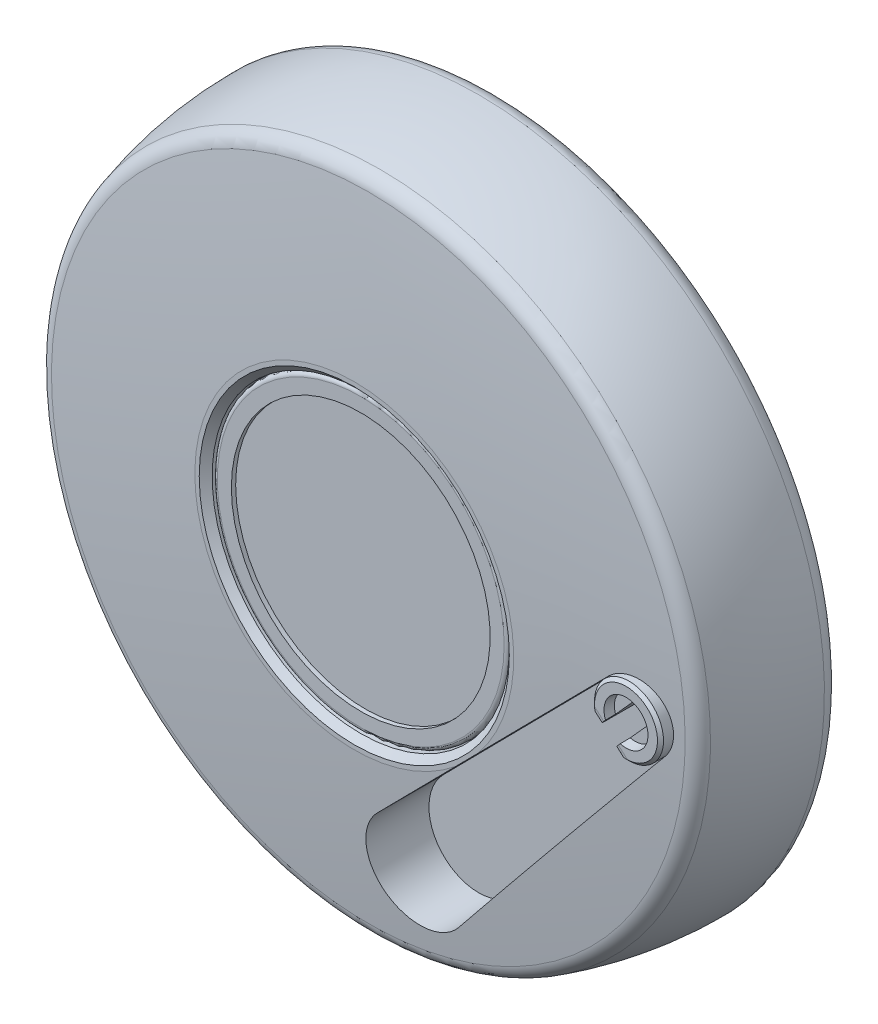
ISO-10303-21;
HEADER;
FILE_DESCRIPTION(('STEP AP214'),'2;1');
FILE_NAME('part.step','',(''),(''),'','','');
FILE_SCHEMA(('AUTOMOTIVE_DESIGN { 1 0 10303 214 1 1 1 1 }'));
ENDSEC;
DATA;
#1=APPLICATION_CONTEXT('core data for automotive mechanical design processes');
#2=APPLICATION_PROTOCOL_DEFINITION('international standard','automotive_design',2000,#1);
#3=PRODUCT_CONTEXT('',#1,'mechanical');
#4=PRODUCT('Part','Part','',(#3));
#5=PRODUCT_RELATED_PRODUCT_CATEGORY('part','',(#4));
#6=PRODUCT_DEFINITION_FORMATION('','',#4);
#7=PRODUCT_DEFINITION_CONTEXT('part definition',#1,'design');
#8=PRODUCT_DEFINITION('design','',#6,#7);
#9=PRODUCT_DEFINITION_SHAPE('','',#8);
#10=(LENGTH_UNIT() NAMED_UNIT(*) SI_UNIT(.MILLI.,.METRE.));
#11=(NAMED_UNIT(*) PLANE_ANGLE_UNIT() SI_UNIT($,.RADIAN.));
#12=(NAMED_UNIT(*) SI_UNIT($,.STERADIAN.) SOLID_ANGLE_UNIT());
#13=UNCERTAINTY_MEASURE_WITH_UNIT(LENGTH_MEASURE(1.E-05),#10,'distance_accuracy_value','');
#14=(GEOMETRIC_REPRESENTATION_CONTEXT(3) GLOBAL_UNCERTAINTY_ASSIGNED_CONTEXT((#13)) GLOBAL_UNIT_ASSIGNED_CONTEXT((#10,
#11,#12)) REPRESENTATION_CONTEXT('',''));
#15=CARTESIAN_POINT('',(0.,0.,0.));
#16=DIRECTION('',(0.,0.,1.));
#17=DIRECTION('',(1.,0.,0.));
#18=AXIS2_PLACEMENT_3D('',#15,#16,#17);
#19=CARTESIAN_POINT('',(0.,0.,29.644784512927));
#20=DIRECTION('',(0.,0.,1.));
#21=DIRECTION('',(0.,1.,0.));
#22=AXIS2_PLACEMENT_3D('',#19,#20,#21);
#23=PLANE('',#22);
#24=CARTESIAN_POINT('',(0.,0.,29.644784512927));
#25=DIRECTION('',(0.,0.,1.));
#26=DIRECTION('',(0.,1.,0.));
#27=AXIS2_PLACEMENT_3D('',#24,#25,#26);
#28=CIRCLE('',#27,6.);
#29=CARTESIAN_POINT('',(0.,6.,29.644784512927));
#30=VERTEX_POINT('',#29);
#31=EDGE_CURVE('E1012',#30,#30,#28,.T.);
#32=ORIENTED_EDGE('',*,*,#31,.F.);
#33=EDGE_LOOP('',(#32));
#34=FACE_BOUND('',#33,.T.);
#35=ADVANCED_FACE('F14',(#34),#23,.F.);
#36=CARTESIAN_POINT('',(66.6802183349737,4.08729654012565,52.7));
#37=DIRECTION('',(0.,0.,-1.));
#38=DIRECTION('',(0.743144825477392,-0.669130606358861,0.));
#39=AXIS2_PLACEMENT_3D('',#36,#37,#38);
#40=CONICAL_SURFACE('',#39,1.5,1.04719755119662);
#41=CARTESIAN_POINT('',(66.6802183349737,4.08729654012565,53.5660254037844));
#42=VERTEX_POINT('',#41);
#43=VERTEX_LOOP('',#42);
#44=FACE_BOUND('',#43,.T.);
#45=CARTESIAN_POINT('',(66.6802183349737,4.08729654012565,52.7));
#46=DIRECTION('',(0.,0.,1.));
#47=DIRECTION('',(-0.743144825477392,0.669130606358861,0.));
#48=AXIS2_PLACEMENT_3D('',#45,#46,#47);
#49=CIRCLE('',#48,1.5);
#50=CARTESIAN_POINT('',(65.5655010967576,5.09099244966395,52.7));
#51=VERTEX_POINT('',#50);
#52=EDGE_CURVE('E597',#51,#51,#49,.T.);
#53=ORIENTED_EDGE('',*,*,#52,.F.);
#54=EDGE_LOOP('',(#53));
#55=FACE_BOUND('',#54,.T.);
#56=ADVANCED_FACE('F361',(#44,#55),#40,.F.);
#57=CARTESIAN_POINT('',(63.,0.,52.));
#58=DIRECTION('',(0.,0.,-1.));
#59=DIRECTION('',(0.743144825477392,-0.669130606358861,0.));
#60=AXIS2_PLACEMENT_3D('',#57,#58,#59);
#61=CYLINDRICAL_SURFACE('',#60,1.621);
#62=CARTESIAN_POINT('',(63.,0.,52.379));
#63=DIRECTION('',(0.,0.,-1.));
#64=DIRECTION('',(0.743144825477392,-0.669130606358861,0.));
#65=AXIS2_PLACEMENT_3D('',#62,#63,#64);
#66=CIRCLE('',#65,1.621);
#67=CARTESIAN_POINT('',(64.2046377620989,-1.08466071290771,52.379));
#68=VERTEX_POINT('',#67);
#69=EDGE_CURVE('E599',#68,#68,#66,.T.);
#70=ORIENTED_EDGE('',*,*,#69,.T.);
#71=EDGE_LOOP('',(#70));
#72=FACE_BOUND('',#71,.T.);
#73=CARTESIAN_POINT('',(63.,0.,55.621));
#74=DIRECTION('',(0.,0.,-1.));
#75=DIRECTION('',(0.743144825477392,-0.669130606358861,0.));
#76=AXIS2_PLACEMENT_3D('',#73,#74,#75);
#77=CIRCLE('',#76,1.621);
#78=CARTESIAN_POINT('',(64.2046377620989,-1.08466071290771,55.621));
#79=VERTEX_POINT('',#78);
#80=EDGE_CURVE('E208',#79,#79,#77,.T.);
#81=ORIENTED_EDGE('',*,*,#80,.F.);
#82=EDGE_LOOP('',(#81));
#83=FACE_BOUND('',#82,.T.);
#84=ADVANCED_FACE('F282',(#72,#83),#61,.F.);
#85=CARTESIAN_POINT('',(63.,0.,63.9));
#86=DIRECTION('',(0.,0.,1.));
#87=DIRECTION('',(-0.743144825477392,0.669130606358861,0.));
#88=AXIS2_PLACEMENT_3D('',#85,#86,#87);
#89=CONICAL_SURFACE('',#88,4.8,0.139626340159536);
#90=CARTESIAN_POINT('',(59.3222637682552,-0.668593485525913,56.3435887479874));
#91=CARTESIAN_POINT('',(59.2582934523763,-0.73963971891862,56.8820972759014));
#92=CARTESIAN_POINT('',(59.1953877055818,-0.809503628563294,57.4208848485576));
#93=CARTESIAN_POINT('',(59.071308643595,-0.947307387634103,58.4989018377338));
#94=CARTESIAN_POINT('',(59.0101353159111,-1.01524725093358,59.0381312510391));
#95=CARTESIAN_POINT('',(58.8891247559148,-1.14964309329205,60.1169120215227));
#96=CARTESIAN_POINT('',(58.8292874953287,-1.21609910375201,60.6564633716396));
#97=CARTESIAN_POINT('',(58.7106941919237,-1.34781031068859,61.7358320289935));
#98=CARTESIAN_POINT('',(58.6519381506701,-1.41306550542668,62.2756493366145));
#99=CARTESIAN_POINT('',(58.5561040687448,-1.51950003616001,63.1629696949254));
#100=CARTESIAN_POINT('',(58.5187669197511,-1.56096714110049,63.5104103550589));
#101=CARTESIAN_POINT('',(58.4444183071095,-1.64353964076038,64.2053706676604));
#102=CARTESIAN_POINT('',(58.4074068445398,-1.68464503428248,64.552890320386));
#103=CARTESIAN_POINT('',(58.2948095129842,-1.80969703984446,65.614375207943));
#104=CARTESIAN_POINT('',(58.2196891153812,-1.89312669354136,66.3284507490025));
#105=CARTESIAN_POINT('',(58.0704256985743,-2.05890051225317,67.7568303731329));
#106=CARTESIAN_POINT('',(57.9962826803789,-2.14124467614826,68.4711344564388));
#107=CARTESIAN_POINT('',(57.848794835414,-2.30504652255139,69.8999173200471));
#108=CARTESIAN_POINT('',(57.7754499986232,-2.38650421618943,70.6143960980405));
#109=CARTESIAN_POINT('',(57.6294273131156,-2.54867883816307,72.0435041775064));
#110=CARTESIAN_POINT('',(57.5567494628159,-2.62939576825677,72.7581334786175));
#111=CARTESIAN_POINT('',(57.4843398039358,-2.70981484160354,73.4728231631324));
#112=B_SPLINE_CURVE_WITH_KNOTS('',3,(#90,#91,#92,#93,#94,#95,#96,#97,#98,#99,#100,#101,#102,
#103,#104,#105,#106,#107,#108,#109,#110,#111),.UNSPECIFIED.,.F.,.F.,(4,2,2,2,2,2,2,2,2,2,4),(0.,
1.64077944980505,3.28154706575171,4.9222799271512,6.56301516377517,7.61869347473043,
8.67437527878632,10.842913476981,13.0114539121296,15.1799670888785,17.3484751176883),.UNSPECIFIED.);
#113=CARTESIAN_POINT('',(58.4770884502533,-1.60725577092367,63.9));
#114=VERTEX_POINT('',#113);
#115=CARTESIAN_POINT('',(58.2543826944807,-1.85459557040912,66.));
#116=VERTEX_POINT('',#115);
#117=EDGE_CURVE('E287',#114,#116,#112,.T.);
#118=ORIENTED_EDGE('',*,*,#117,.F.);
#119=CARTESIAN_POINT('',(63.,0.,63.9));
#120=DIRECTION('',(0.,0.,-1.));
#121=DIRECTION('',(0.743144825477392,-0.669130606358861,0.));
#122=AXIS2_PLACEMENT_3D('',#119,#120,#121);
#123=CIRCLE('',#122,4.8);
#124=CARTESIAN_POINT('',(61.8743219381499,-4.66613854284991,63.9));
#125=VERTEX_POINT('',#124);
#126=EDGE_CURVE('E510',#114,#125,#123,.T.);
#127=ORIENTED_EDGE('',*,*,#126,.T.);
#128=CARTESIAN_POINT('',(60.8815732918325,-5.76869761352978,73.4728231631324));
#129=CARTESIAN_POINT('',(60.9539810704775,-5.68828062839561,72.7581149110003));
#130=CARTESIAN_POINT('',(61.0266625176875,-5.60755970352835,72.0434688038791));
#131=CARTESIAN_POINT('',(61.1726922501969,-5.44537725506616,70.6143289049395));
#132=CARTESIAN_POINT('',(61.2460405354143,-5.36391573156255,69.8998351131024));
#133=CARTESIAN_POINT('',(61.4672599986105,-5.11822662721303,67.7566717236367));
#134=CARTESIAN_POINT('',(61.616310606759,-4.95268915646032,66.3282723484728));
#135=CARTESIAN_POINT('',(61.8435072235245,-4.70036175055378,64.186507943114));
#136=CARTESIAN_POINT('',(61.9198440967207,-4.61558106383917,63.4727144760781));
#137=CARTESIAN_POINT('',(62.0740713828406,-4.44429430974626,62.0455046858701));
#138=CARTESIAN_POINT('',(62.1519617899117,-4.35778824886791,61.3320883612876));
#139=CARTESIAN_POINT('',(62.3097674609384,-4.18252729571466,59.9057297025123));
#140=CARTESIAN_POINT('',(62.389682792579,-4.09377232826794,59.1927873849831));
#141=CARTESIAN_POINT('',(62.5116141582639,-3.95835382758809,58.1238934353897));
#142=CARTESIAN_POINT('',(62.5526012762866,-3.91283302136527,57.7676797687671));
#143=CARTESIAN_POINT('',(62.6353981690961,-3.82087775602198,57.0554648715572));
#144=CARTESIAN_POINT('',(62.6772079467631,-3.7744432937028,56.6994636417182));
#145=CARTESIAN_POINT('',(62.7194972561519,-3.72747625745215,56.3435887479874));
#146=B_SPLINE_CURVE_WITH_KNOTS('',3,(#128,#129,#130,#131,#132,#133,#134,#135,#136,#137,#138,
#139,#140,#141,#142,#143,#144,#145),.UNSPECIFIED.,.F.,.F.,(4,2,2,2,2,2,2,2,4),(0.,
2.1685608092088,4.33712135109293,8.67409752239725,10.8426531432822,13.0112005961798,
15.1798206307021,16.2641444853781,17.3484721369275),.UNSPECIFIED.);
#147=CARTESIAN_POINT('',(61.6516161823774,-4.91347834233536,66.));
#148=VERTEX_POINT('',#147);
#149=EDGE_CURVE('E264',#148,#125,#146,.T.);
#150=ORIENTED_EDGE('',*,*,#149,.F.);
#151=CARTESIAN_POINT('',(63.,0.,66.));
#152=DIRECTION('',(0.,0.,-1.));
#153=DIRECTION('',(0.743144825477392,-0.669130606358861,0.));
#154=AXIS2_PLACEMENT_3D('',#151,#152,#153);
#155=CIRCLE('',#154,5.095135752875);
#156=EDGE_CURVE('E508',#116,#148,#155,.T.);
#157=ORIENTED_EDGE('',*,*,#156,.F.);
#158=EDGE_LOOP('',(#118,#127,#150,#157));
#159=FACE_BOUND('',#158,.T.);
#160=ADVANCED_FACE('F276',(#159),#89,.F.);
#161=CARTESIAN_POINT('',(63.,0.,63.9));
#162=DIRECTION('',(0.,0.,-1.));
#163=DIRECTION('',(0.743144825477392,-0.669130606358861,0.));
#164=AXIS2_PLACEMENT_3D('',#161,#162,#163);
#165=PLANE('',#164);
#166=DIRECTION('',(-0.669130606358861,-0.743144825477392,0.));
#167=VECTOR('',#166,1.);
#168=CARTESIAN_POINT('',(61.3013832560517,1.52944138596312,63.9));
#169=LINE('',#168,#167);
#170=CARTESIAN_POINT('',(63.3661291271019,3.82257399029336,63.9));
#171=VERTEX_POINT('',#170);
#172=EDGE_CURVE('E294',#171,#114,#169,.T.);
#173=ORIENTED_EDGE('',*,*,#172,.F.);
#174=CARTESIAN_POINT('',(64.0455758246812,3.21079743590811,63.9));
#175=DIRECTION('',(0.,0.,-1.));
#176=DIRECTION('',(0.743144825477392,-0.669130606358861,0.));
#177=AXIS2_PLACEMENT_3D('',#174,#175,#176);
#178=CIRCLE('',#177,0.914285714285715);
#179=CARTESIAN_POINT('',(64.6573523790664,3.89024413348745,63.9));
#180=VERTEX_POINT('',#179);
#181=EDGE_CURVE('E198',#180,#171,#178,.F.);
#182=ORIENTED_EDGE('',*,*,#181,.F.);
#183=DIRECTION('',(-0.743144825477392,0.669130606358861,0.));
#184=VECTOR('',#183,1.);
#185=CARTESIAN_POINT('',(65.6765224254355,2.97257930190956,63.9));
#186=LINE('',#185,#184);
#187=CARTESIAN_POINT('',(66.6956924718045,2.05491447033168,63.9));
#188=VERTEX_POINT('',#187);
#189=EDGE_CURVE('E642',#188,#180,#186,.T.);
#190=ORIENTED_EDGE('',*,*,#189,.F.);
#191=CARTESIAN_POINT('',(66.0839159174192,1.37546777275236,63.9));
#192=DIRECTION('',(0.,0.,-1.));
#193=DIRECTION('',(0.743144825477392,-0.669130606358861,0.));
#194=AXIS2_PLACEMENT_3D('',#191,#192,#193);
#195=CIRCLE('',#194,0.914285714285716);
#196=CARTESIAN_POINT('',(66.7633626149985,0.763691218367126,63.9));
#197=VERTEX_POINT('',#196);
#198=EDGE_CURVE('E619',#197,#188,#195,.F.);
#199=ORIENTED_EDGE('',*,*,#198,.F.);
#200=DIRECTION('',(0.669130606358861,0.743144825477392,0.));
#201=VECTOR('',#200,1.);
#202=CARTESIAN_POINT('',(64.6986167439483,-1.52944138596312,63.9));
#203=LINE('',#202,#201);
#204=EDGE_CURVE('E272',#125,#197,#203,.T.);
#205=ORIENTED_EDGE('',*,*,#204,.F.);
#206=ORIENTED_EDGE('',*,*,#126,.F.);
#207=EDGE_LOOP('',(#173,#182,#190,#199,#205,#206));
#208=FACE_BOUND('',#207,.T.);
#209=ADVANCED_FACE('F281',(#208),#165,.F.);
#210=CARTESIAN_POINT('',(68.9451586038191,-5.35304485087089,59.5675675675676));
#211=DIRECTION('',(0.743144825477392,-0.669130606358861,0.));
#212=DIRECTION('',(0.669130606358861,0.743144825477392,0.));
#213=AXIS2_PLACEMENT_3D('',#210,#211,#212);
#214=CYLINDRICAL_SURFACE('',#213,1.6);
#215=CARTESIAN_POINT('',(64.6986167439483,-1.52944138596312,59.5675675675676));
#216=DIRECTION('',(-0.743144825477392,0.669130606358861,0.));
#217=DIRECTION('',(-0.669130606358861,-0.743144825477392,0.));
#218=AXIS2_PLACEMENT_3D('',#215,#216,#217);
#219=CIRCLE('',#218,1.6);
#220=CARTESIAN_POINT('',(63.6280077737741,-2.71847310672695,59.5675675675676));
#221=VERTEX_POINT('',#220);
#222=EDGE_CURVE('E217',#221,#221,#219,.F.);
#223=ORIENTED_EDGE('',*,*,#222,.F.);
#224=EDGE_LOOP('',(#223));
#225=FACE_BOUND('',#224,.T.);
#226=CARTESIAN_POINT('',(61.3013832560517,1.52944138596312,59.5675675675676));
#227=DIRECTION('',(0.743144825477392,-0.669130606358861,0.));
#228=DIRECTION('',(0.669130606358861,0.743144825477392,0.));
#229=AXIS2_PLACEMENT_3D('',#226,#227,#228);
#230=CIRCLE('',#229,1.6);
#231=CARTESIAN_POINT('',(62.3719922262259,2.71847310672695,59.5675675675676));
#232=VERTEX_POINT('',#231);
#233=EDGE_CURVE('E218',#232,#232,#230,.F.);
#234=ORIENTED_EDGE('',*,*,#233,.F.);
#235=EDGE_LOOP('',(#234));
#236=FACE_BOUND('',#235,.T.);
#237=ADVANCED_FACE('F396',(#225,#236),#214,.T.);
#238=CARTESIAN_POINT('',(64.0455758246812,3.21079743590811,72.));
#239=DIRECTION('',(0.,0.,-1.));
#240=DIRECTION('',(0.743144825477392,-0.669130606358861,0.));
#241=AXIS2_PLACEMENT_3D('',#238,#239,#240);
#242=CYLINDRICAL_SURFACE('',#241,0.914285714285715);
#243=ORIENTED_EDGE('',*,*,#181,.T.);
#244=DIRECTION('',(0.,0.,-1.));
#245=VECTOR('',#244,1.);
#246=CARTESIAN_POINT('',(63.3661291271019,3.82257399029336,72.));
#247=LINE('',#246,#245);
#248=CARTESIAN_POINT('',(63.3661291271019,3.82257399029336,56.));
#249=VERTEX_POINT('',#248);
#250=EDGE_CURVE('E486',#171,#249,#247,.T.);
#251=ORIENTED_EDGE('',*,*,#250,.T.);
#252=CARTESIAN_POINT('',(64.0455758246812,3.21079743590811,56.));
#253=DIRECTION('',(0.,0.,1.));
#254=DIRECTION('',(-0.669130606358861,-0.743144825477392,0.));
#255=AXIS2_PLACEMENT_3D('',#252,#253,#254);
#256=CIRCLE('',#255,0.914285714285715);
#257=CARTESIAN_POINT('',(64.6573523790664,3.89024413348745,56.));
#258=VERTEX_POINT('',#257);
#259=EDGE_CURVE('E474',#258,#249,#256,.T.);
#260=ORIENTED_EDGE('',*,*,#259,.F.);
#261=DIRECTION('',(0.,0.,-1.));
#262=VECTOR('',#261,1.);
#263=CARTESIAN_POINT('',(64.6573523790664,3.89024413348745,72.));
#264=LINE('',#263,#262);
#265=EDGE_CURVE('E488',#180,#258,#264,.T.);
#266=ORIENTED_EDGE('',*,*,#265,.F.);
#267=EDGE_LOOP('',(#243,#251,#260,#266));
#268=FACE_BOUND('',#267,.T.);
#269=ADVANCED_FACE('F627',(#268),#242,.F.);
#270=CARTESIAN_POINT('',(66.6956924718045,2.05491447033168,72.));
#271=DIRECTION('',(-0.669130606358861,-0.743144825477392,0.));
#272=DIRECTION('',(0.743144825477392,-0.669130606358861,0.));
#273=AXIS2_PLACEMENT_3D('',#270,#271,#272);
#274=PLANE('',#273);
#275=ORIENTED_EDGE('',*,*,#189,.T.);
#276=ORIENTED_EDGE('',*,*,#265,.T.);
#277=DIRECTION('',(-0.743144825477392,0.669130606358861,0.));
#278=VECTOR('',#277,1.);
#279=CARTESIAN_POINT('',(66.6956924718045,2.05491447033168,56.));
#280=LINE('',#279,#278);
#281=CARTESIAN_POINT('',(66.6956924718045,2.05491447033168,56.));
#282=VERTEX_POINT('',#281);
#283=EDGE_CURVE('E469',#282,#258,#280,.T.);
#284=ORIENTED_EDGE('',*,*,#283,.F.);
#285=DIRECTION('',(0.,0.,-1.));
#286=VECTOR('',#285,1.);
#287=CARTESIAN_POINT('',(66.6956924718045,2.05491447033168,72.));
#288=LINE('',#287,#286);
#289=EDGE_CURVE('E490',#188,#282,#288,.T.);
#290=ORIENTED_EDGE('',*,*,#289,.F.);
#291=EDGE_LOOP('',(#275,#276,#284,#290));
#292=FACE_BOUND('',#291,.T.);
#293=ADVANCED_FACE('F622',(#292),#274,.T.);
#294=CARTESIAN_POINT('',(66.0839159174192,1.37546777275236,72.));
#295=DIRECTION('',(0.,0.,-1.));
#296=DIRECTION('',(0.743144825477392,-0.669130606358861,0.));
#297=AXIS2_PLACEMENT_3D('',#294,#295,#296);
#298=CYLINDRICAL_SURFACE('',#297,0.914285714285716);
#299=ORIENTED_EDGE('',*,*,#198,.T.);
#300=ORIENTED_EDGE('',*,*,#289,.T.);
#301=CARTESIAN_POINT('',(66.0839159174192,1.37546777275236,56.));
#302=DIRECTION('',(0.,0.,1.));
#303=DIRECTION('',(-0.669130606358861,-0.743144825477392,0.));
#304=AXIS2_PLACEMENT_3D('',#301,#302,#303);
#305=CIRCLE('',#304,0.914285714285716);
#306=CARTESIAN_POINT('',(66.7633626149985,0.763691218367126,56.));
#307=VERTEX_POINT('',#306);
#308=EDGE_CURVE('E467',#307,#282,#305,.T.);
#309=ORIENTED_EDGE('',*,*,#308,.F.);
#310=DIRECTION('',(0.,0.,-1.));
#311=VECTOR('',#310,1.);
#312=CARTESIAN_POINT('',(66.7633626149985,0.763691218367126,72.));
#313=LINE('',#312,#311);
#314=EDGE_CURVE('E484',#197,#307,#313,.T.);
#315=ORIENTED_EDGE('',*,*,#314,.F.);
#316=EDGE_LOOP('',(#299,#300,#309,#315));
#317=FACE_BOUND('',#316,.T.);
#318=ADVANCED_FACE('F388',(#317),#298,.F.);
#319=CARTESIAN_POINT('',(63.,0.,56.));
#320=DIRECTION('',(0.,0.,1.));
#321=DIRECTION('',(-0.743144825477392,0.669130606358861,0.));
#322=AXIS2_PLACEMENT_3D('',#319,#320,#321);
#323=CONICAL_SURFACE('',#322,2.,0.785398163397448);
#324=ORIENTED_EDGE('',*,*,#80,.T.);
#325=EDGE_LOOP('',(#324));
#326=FACE_BOUND('',#325,.T.);
#327=CARTESIAN_POINT('',(63.,0.,56.));
#328=DIRECTION('',(0.,0.,-1.));
#329=DIRECTION('',(0.743144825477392,-0.669130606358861,0.));
#330=AXIS2_PLACEMENT_3D('',#327,#328,#329);
#331=CIRCLE('',#330,2.);
#332=CARTESIAN_POINT('',(64.4862896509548,-1.33826121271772,56.));
#333=VERTEX_POINT('',#332);
#334=EDGE_CURVE('E202',#333,#333,#331,.T.);
#335=ORIENTED_EDGE('',*,*,#334,.F.);
#336=EDGE_LOOP('',(#335));
#337=FACE_BOUND('',#336,.T.);
#338=ADVANCED_FACE('F381',(#326,#337),#323,.F.);
#339=CARTESIAN_POINT('',(66.6802183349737,4.08729654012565,53.5660254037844));
#340=DIRECTION('',(0.,0.,1.));
#341=DIRECTION('',(-0.743144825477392,0.669130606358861,0.));
#342=AXIS2_PLACEMENT_3D('',#339,#340,#341);
#343=CYLINDRICAL_SURFACE('',#342,1.5);
#344=ORIENTED_EDGE('',*,*,#52,.T.);
#345=EDGE_LOOP('',(#344));
#346=FACE_BOUND('',#345,.T.);
#347=CARTESIAN_POINT('',(66.6802183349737,4.08729654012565,52.));
#348=DIRECTION('',(0.,0.,1.));
#349=DIRECTION('',(-0.743144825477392,0.669130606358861,0.));
#350=AXIS2_PLACEMENT_3D('',#347,#348,#349);
#351=CIRCLE('',#350,1.5);
#352=CARTESIAN_POINT('',(65.5655010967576,5.09099244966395,52.));
#353=VERTEX_POINT('',#352);
#354=EDGE_CURVE('E595',#353,#353,#351,.T.);
#355=ORIENTED_EDGE('',*,*,#354,.F.);
#356=EDGE_LOOP('',(#355));
#357=FACE_BOUND('',#356,.T.);
#358=ADVANCED_FACE('F377',(#346,#357),#343,.F.);
#359=CARTESIAN_POINT('',(63.,0.,52.379));
#360=DIRECTION('',(0.,0.,-1.));
#361=DIRECTION('',(0.743144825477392,-0.669130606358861,0.));
#362=AXIS2_PLACEMENT_3D('',#359,#360,#361);
#363=CONICAL_SURFACE('',#362,1.621,0.785398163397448);
#364=CARTESIAN_POINT('',(63.,0.,52.));
#365=DIRECTION('',(0.,0.,-1.));
#366=DIRECTION('',(0.743144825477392,-0.669130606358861,0.));
#367=AXIS2_PLACEMENT_3D('',#364,#365,#366);
#368=CIRCLE('',#367,2.);
#369=CARTESIAN_POINT('',(64.4862896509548,-1.33826121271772,52.));
#370=VERTEX_POINT('',#369);
#371=EDGE_CURVE('E592',#370,#370,#368,.T.);
#372=ORIENTED_EDGE('',*,*,#371,.T.);
#373=EDGE_LOOP('',(#372));
#374=FACE_BOUND('',#373,.T.);
#375=ORIENTED_EDGE('',*,*,#69,.F.);
#376=EDGE_LOOP('',(#375));
#377=FACE_BOUND('',#376,.T.);
#378=ADVANCED_FACE('F380',(#374,#377),#363,.F.);
#379=CARTESIAN_POINT('',(59.590688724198,-3.78642376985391,66.));
#380=DIRECTION('',(0.,0.,-1.));
#381=DIRECTION('',(0.743144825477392,-0.669130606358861,0.));
#382=AXIS2_PLACEMENT_3D('',#379,#380,#381);
#383=PLANE('',#382);
#384=DIRECTION('',(-0.669130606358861,-0.743144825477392,0.));
#385=VECTOR('',#384,1.);
#386=CARTESIAN_POINT('',(57.8920719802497,-2.25698238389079,66.));
#387=LINE('',#386,#385);
#388=CARTESIAN_POINT('',(57.8352867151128,-2.32004881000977,66.));
#389=VERTEX_POINT('',#388);
#390=EDGE_CURVE('E295',#116,#389,#387,.T.);
#391=ORIENTED_EDGE('',*,*,#390,.F.);
#392=ORIENTED_EDGE('',*,*,#156,.T.);
#393=DIRECTION('',(0.669130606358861,0.743144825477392,0.));
#394=VECTOR('',#393,1.);
#395=CARTESIAN_POINT('',(61.2893054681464,-5.31586515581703,66.));
#396=LINE('',#395,#394);
#397=CARTESIAN_POINT('',(61.2325202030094,-5.37893158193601,66.));
#398=VERTEX_POINT('',#397);
#399=EDGE_CURVE('E273',#398,#148,#396,.T.);
#400=ORIENTED_EDGE('',*,*,#399,.F.);
#401=DIRECTION('',(0.743144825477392,-0.669130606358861,0.));
#402=VECTOR('',#401,1.);
#403=CARTESIAN_POINT('',(47.6435862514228,6.85659950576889,66.));
#404=LINE('',#403,#402);
#405=CARTESIAN_POINT('',(63.3564139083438,-7.29129406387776,66.));
#406=VERTEX_POINT('',#405);
#407=EDGE_CURVE('E301',#398,#406,#404,.T.);
#408=ORIENTED_EDGE('',*,*,#407,.T.);
#409=CARTESIAN_POINT('',(63.,0.,66.));
#410=DIRECTION('',(0.,0.,-1.));
#411=DIRECTION('',(0.743144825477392,-0.669130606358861,0.));
#412=AXIS2_PLACEMENT_3D('',#409,#410,#411);
#413=CIRCLE('',#412,7.3);
#414=CARTESIAN_POINT('',(55.7113930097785,-0.407686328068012,66.));
#415=VERTEX_POINT('',#414);
#416=EDGE_CURVE('E512',#415,#406,#413,.T.);
#417=ORIENTED_EDGE('',*,*,#416,.F.);
#418=EDGE_CURVE('E302',#415,#389,#404,.T.);
#419=ORIENTED_EDGE('',*,*,#418,.T.);
#420=EDGE_LOOP('',(#391,#392,#400,#408,#417,#419));
#421=FACE_BOUND('',#420,.T.);
#422=ADVANCED_FACE('F259',(#421),#383,.F.);
#423=CARTESIAN_POINT('',(56.669049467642,-10.4471792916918,72.));
#424=DIRECTION('',(-0.743144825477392,0.669130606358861,0.));
#425=DIRECTION('',(-0.669130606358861,-0.743144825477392,0.));
#426=AXIS2_PLACEMENT_3D('',#423,#424,#425);
#427=PLANE('',#426);
#428=ORIENTED_EDGE('',*,*,#222,.T.);
#429=EDGE_LOOP('',(#428));
#430=FACE_BOUND('',#429,.T.);
#431=ORIENTED_EDGE('',*,*,#204,.T.);
#432=ORIENTED_EDGE('',*,*,#314,.T.);
#433=DIRECTION('',(0.669130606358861,0.743144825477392,0.));
#434=VECTOR('',#433,1.);
#435=CARTESIAN_POINT('',(56.669049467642,-10.4471792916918,56.));
#436=LINE('',#435,#434);
#437=CARTESIAN_POINT('',(60.0147024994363,-6.73145516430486,56.));
#438=VERTEX_POINT('',#437);
#439=EDGE_CURVE('E482',#438,#307,#436,.T.);
#440=ORIENTED_EDGE('',*,*,#439,.F.);
#441=DIRECTION('',(0.,0.,-1.));
#442=VECTOR('',#441,1.);
#443=CARTESIAN_POINT('',(60.0147024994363,-6.73145516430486,64.18));
#444=LINE('',#443,#442);
#445=CARTESIAN_POINT('',(60.0147024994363,-6.73145516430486,64.1800000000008));
#446=VERTEX_POINT('',#445);
#447=EDGE_CURVE('E491',#446,#438,#444,.T.);
#448=ORIENTED_EDGE('',*,*,#447,.F.);
#449=CARTESIAN_POINT('',(61.2325202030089,-5.3789315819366,64.1800000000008));
#450=DIRECTION('',(-0.743144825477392,0.669130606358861,0.));
#451=DIRECTION('',(-0.669130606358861,-0.743144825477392,0.));
#452=AXIS2_PLACEMENT_3D('',#449,#450,#451);
#453=CIRCLE('',#452,1.81999999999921);
#454=EDGE_CURVE('E501',#446,#398,#453,.T.);
#455=ORIENTED_EDGE('',*,*,#454,.T.);
#456=ORIENTED_EDGE('',*,*,#399,.T.);
#457=ORIENTED_EDGE('',*,*,#149,.T.);
#458=EDGE_LOOP('',(#431,#432,#440,#448,#455,#456,#457));
#459=FACE_BOUND('',#458,.T.);
#460=ADVANCED_FACE('F255',(#430,#459),#427,.T.);
#461=CARTESIAN_POINT('',(63.3661291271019,3.82257399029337,72.));
#462=DIRECTION('',(0.743144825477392,-0.669130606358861,0.));
#463=DIRECTION('',(0.669130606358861,0.743144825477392,0.));
#464=AXIS2_PLACEMENT_3D('',#461,#462,#463);
#465=PLANE('',#464);
#466=ORIENTED_EDGE('',*,*,#233,.T.);
#467=EDGE_LOOP('',(#466));
#468=FACE_BOUND('',#467,.T.);
#469=ORIENTED_EDGE('',*,*,#172,.T.);
#470=ORIENTED_EDGE('',*,*,#117,.T.);
#471=ORIENTED_EDGE('',*,*,#390,.T.);
#472=CARTESIAN_POINT('',(57.8352867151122,-2.32004881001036,64.1800000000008));
#473=DIRECTION('',(0.743144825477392,-0.669130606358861,0.));
#474=DIRECTION('',(0.669130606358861,0.743144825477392,0.));
#475=AXIS2_PLACEMENT_3D('',#472,#473,#474);
#476=CIRCLE('',#475,1.81999999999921);
#477=CARTESIAN_POINT('',(56.6174690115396,-3.67257239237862,64.1800000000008));
#478=VERTEX_POINT('',#477);
#479=EDGE_CURVE('E637',#389,#478,#476,.T.);
#480=ORIENTED_EDGE('',*,*,#479,.T.);
#481=DIRECTION('',(0.,0.,1.));
#482=VECTOR('',#481,1.);
#483=CARTESIAN_POINT('',(56.6174690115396,-3.67257239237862,64.18));
#484=LINE('',#483,#482);
#485=CARTESIAN_POINT('',(56.6174690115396,-3.67257239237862,56.));
#486=VERTEX_POINT('',#485);
#487=EDGE_CURVE('E633',#486,#478,#484,.T.);
#488=ORIENTED_EDGE('',*,*,#487,.F.);
#489=DIRECTION('',(-0.669130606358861,-0.743144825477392,0.));
#490=VECTOR('',#489,1.);
#491=CARTESIAN_POINT('',(63.3661291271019,3.82257399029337,56.));
#492=LINE('',#491,#490);
#493=EDGE_CURVE('E479',#249,#486,#492,.T.);
#494=ORIENTED_EDGE('',*,*,#493,.F.);
#495=ORIENTED_EDGE('',*,*,#250,.F.);
#496=EDGE_LOOP('',(#469,#470,#471,#480,#488,#494,#495));
#497=FACE_BOUND('',#496,.T.);
#498=ADVANCED_FACE('F253',(#468,#497),#465,.T.);
#499=CARTESIAN_POINT('',(66.0839159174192,1.37546777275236,56.));
#500=DIRECTION('',(0.,0.,1.));
#501=DIRECTION('',(-0.743144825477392,0.669130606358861,0.));
#502=AXIS2_PLACEMENT_3D('',#499,#500,#501);
#503=PLANE('',#502);
#504=ORIENTED_EDGE('',*,*,#334,.T.);
#505=EDGE_LOOP('',(#504));
#506=FACE_BOUND('',#505,.T.);
#507=ORIENTED_EDGE('',*,*,#439,.T.);
#508=ORIENTED_EDGE('',*,*,#308,.T.);
#509=ORIENTED_EDGE('',*,*,#283,.T.);
#510=ORIENTED_EDGE('',*,*,#259,.T.);
#511=ORIENTED_EDGE('',*,*,#493,.T.);
#512=DIRECTION('',(-0.743144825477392,0.669130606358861,0.));
#513=VECTOR('',#512,1.);
#514=CARTESIAN_POINT('',(46.4257685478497,5.50407592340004,56.));
#515=LINE('',#514,#513);
#516=EDGE_CURVE('E613',#438,#486,#515,.T.);
#517=ORIENTED_EDGE('',*,*,#516,.F.);
#518=EDGE_LOOP('',(#507,#508,#509,#510,#511,#517));
#519=FACE_BOUND('',#518,.T.);
#520=ADVANCED_FACE('F248',(#506,#519),#503,.T.);
#521=CARTESIAN_POINT('',(48.5781861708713,-8.54466417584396,53.7));
#522=DIRECTION('',(0.,0.,-1.));
#523=DIRECTION('',(0.743144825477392,-0.669130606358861,0.));
#524=AXIS2_PLACEMENT_3D('',#521,#522,#523);
#525=PLANE('',#524);
#526=CARTESIAN_POINT('',(63.,0.,53.7));
#527=DIRECTION('',(0.,0.,-1.));
#528=DIRECTION('',(0.743144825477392,-0.669130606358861,0.));
#529=AXIS2_PLACEMENT_3D('',#526,#527,#528);
#530=CIRCLE('',#529,8.);
#531=CARTESIAN_POINT('',(55.1055565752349,-1.29528491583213,53.7));
#532=VERTEX_POINT('',#531);
#533=CARTESIAN_POINT('',(63.4629951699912,7.98659097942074,53.7));
#534=VERTEX_POINT('',#533);
#535=EDGE_CURVE('E525',#532,#534,#530,.T.);
#536=ORIENTED_EDGE('',*,*,#535,.T.);
#537=DIRECTION('',(0.669130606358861,0.743144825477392,0.));
#538=VECTOR('',#537,1.);
#539=CARTESIAN_POINT('',(48.5781861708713,-8.54466417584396,53.7));
#540=LINE('',#539,#538);
#541=EDGE_CURVE('E555',#532,#534,#540,.T.);
#542=ORIENTED_EDGE('',*,*,#541,.F.);
#543=EDGE_LOOP('',(#536,#542));
#544=FACE_BOUND('',#543,.T.);
#545=ADVANCED_FACE('F252',(#544),#525,.T.);
#546=CARTESIAN_POINT('',(48.5781861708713,-8.54466417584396,52.));
#547=DIRECTION('',(-0.743144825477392,0.669130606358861,0.));
#548=DIRECTION('',(-0.669130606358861,-0.743144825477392,0.));
#549=AXIS2_PLACEMENT_3D('',#546,#547,#548);
#550=PLANE('',#549);
#551=DIRECTION('',(0.,0.,-1.));
#552=VECTOR('',#551,1.);
#553=CARTESIAN_POINT('',(63.4629951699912,7.98659097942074,52.));
#554=LINE('',#553,#552);
#555=CARTESIAN_POINT('',(63.4629951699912,7.98659097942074,52.));
#556=VERTEX_POINT('',#555);
#557=EDGE_CURVE('E549',#534,#556,#554,.T.);
#558=ORIENTED_EDGE('',*,*,#557,.T.);
#559=DIRECTION('',(-0.669130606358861,-0.743144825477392,0.));
#560=VECTOR('',#559,1.);
#561=CARTESIAN_POINT('',(53.9312310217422,-2.59950557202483,52.));
#562=LINE('',#561,#560);
#563=CARTESIAN_POINT('',(55.1055565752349,-1.29528491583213,52.));
#564=VERTEX_POINT('',#563);
#565=EDGE_CURVE('E514',#556,#564,#562,.T.);
#566=ORIENTED_EDGE('',*,*,#565,.T.);
#567=DIRECTION('',(0.,0.,-1.));
#568=VECTOR('',#567,1.);
#569=CARTESIAN_POINT('',(55.1055565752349,-1.29528491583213,52.));
#570=LINE('',#569,#568);
#571=EDGE_CURVE('E551',#564,#532,#570,.F.);
#572=ORIENTED_EDGE('',*,*,#571,.T.);
#573=ORIENTED_EDGE('',*,*,#541,.T.);
#574=EDGE_LOOP('',(#558,#566,#572,#573));
#575=FACE_BOUND('',#574,.T.);
#576=ADVANCED_FACE('F577',(#575),#550,.T.);
#577=CARTESIAN_POINT('',(59.7253585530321,-18.5816232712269,53.7));
#578=DIRECTION('',(0.,0.,-1.));
#579=DIRECTION('',(0.743144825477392,-0.669130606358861,0.));
#580=AXIS2_PLACEMENT_3D('',#577,#578,#579);
#581=PLANE('',#580);
#582=CARTESIAN_POINT('',(63.,0.,53.7));
#583=DIRECTION('',(0.,0.,-1.));
#584=DIRECTION('',(0.743144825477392,-0.669130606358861,0.));
#585=AXIS2_PLACEMENT_3D('',#582,#583,#584);
#586=CIRCLE('',#585,8.);
#587=CARTESIAN_POINT('',(70.8944434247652,1.29528491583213,53.7));
#588=VERTEX_POINT('',#587);
#589=CARTESIAN_POINT('',(62.5370048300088,-7.98659097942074,53.7));
#590=VERTEX_POINT('',#589);
#591=EDGE_CURVE('E526',#588,#590,#586,.T.);
#592=ORIENTED_EDGE('',*,*,#591,.T.);
#593=DIRECTION('',(0.669130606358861,0.743144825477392,0.));
#594=VECTOR('',#593,1.);
#595=CARTESIAN_POINT('',(56.0096344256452,-15.2359702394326,53.7));
#596=LINE('',#595,#594);
#597=EDGE_CURVE('E553',#590,#588,#596,.T.);
#598=ORIENTED_EDGE('',*,*,#597,.T.);
#599=EDGE_LOOP('',(#592,#598));
#600=FACE_BOUND('',#599,.T.);
#601=ADVANCED_FACE('F575',(#600),#581,.T.);
#602=CARTESIAN_POINT('',(56.0096344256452,-15.2359702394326,53.7));
#603=DIRECTION('',(0.743144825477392,-0.669130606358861,0.));
#604=DIRECTION('',(0.669130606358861,0.743144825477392,0.));
#605=AXIS2_PLACEMENT_3D('',#602,#603,#604);
#606=PLANE('',#605);
#607=DIRECTION('',(0.,0.,-1.));
#608=VECTOR('',#607,1.);
#609=CARTESIAN_POINT('',(62.5370048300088,-7.98659097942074,52.));
#610=LINE('',#609,#608);
#611=CARTESIAN_POINT('',(62.5370048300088,-7.98659097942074,52.));
#612=VERTEX_POINT('',#611);
#613=EDGE_CURVE('E545',#590,#612,#610,.T.);
#614=ORIENTED_EDGE('',*,*,#613,.T.);
#615=DIRECTION('',(0.669130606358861,0.743144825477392,0.));
#616=VECTOR('',#615,1.);
#617=CARTESIAN_POINT('',(61.3626792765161,-9.29081163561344,52.));
#618=LINE('',#617,#616);
#619=CARTESIAN_POINT('',(70.8944434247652,1.29528491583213,52.));
#620=VERTEX_POINT('',#619);
#621=EDGE_CURVE('E523',#612,#620,#618,.T.);
#622=ORIENTED_EDGE('',*,*,#621,.T.);
#623=DIRECTION('',(0.,0.,-1.));
#624=VECTOR('',#623,1.);
#625=CARTESIAN_POINT('',(70.8944434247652,1.29528491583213,52.));
#626=LINE('',#625,#624);
#627=EDGE_CURVE('E547',#620,#588,#626,.F.);
#628=ORIENTED_EDGE('',*,*,#627,.T.);
#629=ORIENTED_EDGE('',*,*,#597,.F.);
#630=EDGE_LOOP('',(#614,#622,#628,#629));
#631=FACE_BOUND('',#630,.T.);
#632=ADVANCED_FACE('F574',(#631),#606,.T.);
#633=CARTESIAN_POINT('',(57.6469551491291,-5.94515860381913,52.));
#634=DIRECTION('',(0.,0.,1.));
#635=DIRECTION('',(-0.743144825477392,0.669130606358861,0.));
#636=AXIS2_PLACEMENT_3D('',#633,#634,#635);
#637=PLANE('',#636);
#638=ORIENTED_EDGE('',*,*,#371,.F.);
#639=EDGE_LOOP('',(#638));
#640=FACE_BOUND('',#639,.T.);
#641=ORIENTED_EDGE('',*,*,#354,.T.);
#642=EDGE_LOOP('',(#641));
#643=FACE_BOUND('',#642,.T.);
#644=DIRECTION('',(0.743144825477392,-0.669130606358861,0.));
#645=VECTOR('',#644,1.);
#646=CARTESIAN_POINT('',(58.316085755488,-5.20201377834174,52.));
#647=LINE('',#646,#645);
#648=CARTESIAN_POINT('',(55.4378982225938,-2.6104820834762,52.));
#649=VERTEX_POINT('',#648);
#650=CARTESIAN_POINT('',(61.1942732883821,-7.79354547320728,52.));
#651=VERTEX_POINT('',#650);
#652=EDGE_CURVE('E348',#649,#651,#647,.T.);
#653=ORIENTED_EDGE('',*,*,#652,.F.);
#654=CARTESIAN_POINT('',(63.,0.,52.));
#655=DIRECTION('',(0.,0.,-1.));
#656=DIRECTION('',(0.743144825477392,-0.669130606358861,0.));
#657=AXIS2_PLACEMENT_3D('',#654,#655,#656);
#658=CIRCLE('',#657,8.);
#659=EDGE_CURVE('E540',#649,#564,#658,.T.);
#660=ORIENTED_EDGE('',*,*,#659,.T.);
#661=ORIENTED_EDGE('',*,*,#565,.F.);
#662=EDGE_CURVE('E541',#556,#620,#658,.T.);
#663=ORIENTED_EDGE('',*,*,#662,.T.);
#664=ORIENTED_EDGE('',*,*,#621,.F.);
#665=EDGE_CURVE('E543',#612,#651,#658,.T.);
#666=ORIENTED_EDGE('',*,*,#665,.T.);
#667=EDGE_LOOP('',(#653,#660,#661,#663,#664,#666));
#668=FACE_BOUND('',#667,.T.);
#669=ADVANCED_FACE('F358',(#640,#643,#668),#637,.F.);
#670=CARTESIAN_POINT('',(47.6435862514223,6.8565995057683,64.1800000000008));
#671=DIRECTION('',(0.743144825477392,-0.669130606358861,0.));
#672=DIRECTION('',(0.669130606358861,0.743144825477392,0.));
#673=AXIS2_PLACEMENT_3D('',#670,#671,#672);
#674=CYLINDRICAL_SURFACE('',#673,1.81999999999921);
#675=ORIENTED_EDGE('',*,*,#454,.F.);
#676=DIRECTION('',(0.743144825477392,-0.669130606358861,0.));
#677=VECTOR('',#676,1.);
#678=CARTESIAN_POINT('',(46.4257685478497,5.50407592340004,64.1800000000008));
#679=LINE('',#678,#677);
#680=CARTESIAN_POINT('',(61.1942732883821,-7.79354547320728,64.1800000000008));
#681=VERTEX_POINT('',#680);
#682=EDGE_CURVE('E297',#446,#681,#679,.T.);
#683=ORIENTED_EDGE('',*,*,#682,.T.);
#684=CARTESIAN_POINT('',(61.9179255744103,-7.92648187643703,65.3));
#685=CARTESIAN_POINT('',(61.8751104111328,-7.92064085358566,65.2688460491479));
#686=CARTESIAN_POINT('',(61.8331130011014,-7.9145504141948,65.2365745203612));
#687=CARTESIAN_POINT('',(61.7510486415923,-7.90201447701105,65.169502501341));
#688=CARTESIAN_POINT('',(61.7109874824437,-7.89556802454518,65.1346951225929));
#689=CARTESIAN_POINT('',(61.6323339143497,-7.88232980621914,65.0614976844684));
#690=CARTESIAN_POINT('',(61.5938062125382,-7.87553342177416,65.0230382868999));
#691=CARTESIAN_POINT('',(61.5200614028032,-7.86200894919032,64.9431236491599));
#692=CARTESIAN_POINT('',(61.484840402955,-7.85528078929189,64.9016720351));
#693=CARTESIAN_POINT('',(61.4133515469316,-7.84117784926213,64.808704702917));
#694=CARTESIAN_POINT('',(61.3777838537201,-7.83386685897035,64.7566295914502));
#695=CARTESIAN_POINT('',(61.31450921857,-7.82049595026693,64.6484532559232));
#696=CARTESIAN_POINT('',(61.2867191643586,-7.81442300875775,64.5924033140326));
#697=CARTESIAN_POINT('',(61.2419305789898,-7.80446707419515,64.478607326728));
#698=CARTESIAN_POINT('',(61.2245190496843,-7.80050107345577,64.4210381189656));
#699=CARTESIAN_POINT('',(61.2066156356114,-7.79639725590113,64.3323796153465));
#700=CARTESIAN_POINT('',(61.202013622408,-7.7953358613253,64.302135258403));
#701=CARTESIAN_POINT('',(61.1958322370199,-7.79390676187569,64.2412691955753));
#702=CARTESIAN_POINT('',(61.1942583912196,-7.7935403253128,64.2106469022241));
#703=CARTESIAN_POINT('',(61.1942732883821,-7.79354547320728,64.1800000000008));
#704=B_SPLINE_CURVE_WITH_KNOTS('',3,(#684,#685,#686,#687,#688,#689,#690,#691,#692,#693,#694,
#695,#696,#697,#698,#699,#700,#701,#702,#703),.UNSPECIFIED.,.F.,.F.,(4,2,2,2,2,2,2,2,2,4),(0.,
0.159829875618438,0.320111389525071,0.48453482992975,0.648762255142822,0.838713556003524,
1.02654994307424,1.20630161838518,1.2979886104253,1.38984277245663),.UNSPECIFIED.);
#705=CARTESIAN_POINT('',(61.9179255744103,-7.92648187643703,65.3));
#706=VERTEX_POINT('',#705);
#707=EDGE_CURVE('E305',#706,#681,#704,.T.);
#708=ORIENTED_EDGE('',*,*,#707,.F.);
#709=CARTESIAN_POINT('',(63.6193362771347,-7.28285614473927,65.9908570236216));
#710=CARTESIAN_POINT('',(63.5433176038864,-7.28412686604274,65.9960446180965));
#711=CARTESIAN_POINT('',(63.4671237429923,-7.28632661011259,65.9991164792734));
#712=CARTESIAN_POINT('',(63.3144490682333,-7.29306056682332,66.0005620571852));
#713=CARTESIAN_POINT('',(63.2379685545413,-7.29760551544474,65.998914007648));
#714=CARTESIAN_POINT('',(63.0844106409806,-7.30958769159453,65.9903358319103));
#715=CARTESIAN_POINT('',(63.0073402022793,-7.3170651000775,65.9833309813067));
#716=CARTESIAN_POINT('',(62.8545657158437,-7.33574562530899,65.963207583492));
#717=CARTESIAN_POINT('',(62.7788591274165,-7.34694084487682,65.9501019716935));
#718=CARTESIAN_POINT('',(62.6485965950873,-7.37095124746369,65.9208852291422));
#719=CARTESIAN_POINT('',(62.5934906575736,-7.38265914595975,65.9063480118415));
#720=CARTESIAN_POINT('',(62.485646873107,-7.4097213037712,65.8726362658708));
#721=CARTESIAN_POINT('',(62.4329066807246,-7.42507185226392,65.8534664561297));
#722=CARTESIAN_POINT('',(62.3305676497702,-7.46066798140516,65.809524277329));
#723=CARTESIAN_POINT('',(62.2810189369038,-7.48097497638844,65.784681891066));
#724=CARTESIAN_POINT('',(62.1884330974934,-7.52745090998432,65.7290520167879));
#725=CARTESIAN_POINT('',(62.1453767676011,-7.55360196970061,65.6982826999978));
#726=CARTESIAN_POINT('',(62.0789668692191,-7.60450662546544,65.6399632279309));
#727=CARTESIAN_POINT('',(62.0534070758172,-7.62782978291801,65.6136833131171));
#728=CARTESIAN_POINT('',(62.0086854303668,-7.67757046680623,65.5587192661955));
#729=CARTESIAN_POINT('',(61.9895200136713,-7.7039862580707,65.5300364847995));
#730=CARTESIAN_POINT('',(61.9581183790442,-7.75908428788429,65.4712860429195));
#731=CARTESIAN_POINT('',(61.9458658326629,-7.78776100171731,65.4412218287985));
#732=CARTESIAN_POINT('',(61.927894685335,-7.84657053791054,65.3805267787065));
#733=CARTESIAN_POINT('',(61.9221855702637,-7.8767054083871,65.3498951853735));
#734=CARTESIAN_POINT('',(61.9179485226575,-7.9221155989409,65.3043291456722));
#735=CARTESIAN_POINT('',(61.9172460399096,-7.93716482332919,65.2893235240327));
#736=CARTESIAN_POINT('',(61.9171140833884,-7.96728674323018,65.2594592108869));
#737=CARTESIAN_POINT('',(61.9176791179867,-7.98235905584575,65.2446001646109));
#738=CARTESIAN_POINT('',(61.9188171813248,-7.99744782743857,65.2298));
#739=B_SPLINE_CURVE_WITH_KNOTS('',3,(#709,#710,#711,#712,#713,#714,#715,#716,#717,#718,#719,
#720,#721,#722,#723,#724,#725,#726,#727,#728,#729,#730,#731,#732,#733,#734,#735,#736,#737,#738),
.UNSPECIFIED.,.F.,.F.,(4,2,2,2,2,2,2,2,2,2,2,2,2,2,4),(0.,0.22865250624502,0.458361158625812,
0.691333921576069,0.923814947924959,1.09809226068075,1.272192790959,1.44857108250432,
1.62441698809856,1.7541703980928,1.88385135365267,2.01322470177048,2.14278536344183,
2.20654547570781,2.27002987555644),.UNSPECIFIED.);
#740=EDGE_CURVE('E333',#406,#706,#739,.T.);
#741=ORIENTED_EDGE('',*,*,#740,.F.);
#742=ORIENTED_EDGE('',*,*,#407,.F.);
#743=EDGE_LOOP('',(#675,#683,#708,#741,#742));
#744=FACE_BOUND('',#743,.T.);
#745=ADVANCED_FACE('F327',(#744),#674,.T.);
#746=CARTESIAN_POINT('',(63.,0.,66.));
#747=DIRECTION('',(0.,0.,-1.));
#748=DIRECTION('',(0.743144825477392,-0.669130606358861,0.));
#749=AXIS2_PLACEMENT_3D('',#746,#747,#748);
#750=CONICAL_SURFACE('',#749,7.3,0.785398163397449);
#751=CARTESIAN_POINT('',(63.,0.,65.3));
#752=DIRECTION('',(0.,0.,-1.));
#753=DIRECTION('',(0.743144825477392,-0.669130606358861,0.));
#754=AXIS2_PLACEMENT_3D('',#751,#752,#753);
#755=CIRCLE('',#754,8.);
#756=CARTESIAN_POINT('',(55.2300477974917,-1.9046896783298,65.3));
#757=VERTEX_POINT('',#756);
#758=EDGE_CURVE('E517',#757,#706,#755,.T.);
#759=ORIENTED_EDGE('',*,*,#758,.F.);
#760=CARTESIAN_POINT('',(55.1593774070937,-1.91122091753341,65.2298));
#761=CARTESIAN_POINT('',(55.1965211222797,-1.91023084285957,65.2661057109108));
#762=CARTESIAN_POINT('',(55.2333899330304,-1.90561151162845,65.3030215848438));
#763=CARTESIAN_POINT('',(55.3051675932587,-1.88792545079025,65.3769556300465));
#764=CARTESIAN_POINT('',(55.3400685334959,-1.8748269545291,65.4139736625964));
#765=CARTESIAN_POINT('',(55.4004547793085,-1.84209597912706,65.4803861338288));
#766=CARTESIAN_POINT('',(55.4265226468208,-1.82399330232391,65.5099880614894));
#767=CARTESIAN_POINT('',(55.4751822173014,-1.78142390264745,65.5672045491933));
#768=CARTESIAN_POINT('',(55.4977849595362,-1.75697808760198,65.5948252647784));
#769=CARTESIAN_POINT('',(55.539071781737,-1.7026258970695,65.6472935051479));
#770=CARTESIAN_POINT('',(55.5577644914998,-1.67273182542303,65.6721470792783));
#771=CARTESIAN_POINT('',(55.5913500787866,-1.60865657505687,65.7187665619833));
#772=CARTESIAN_POINT('',(55.6062351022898,-1.57446674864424,65.740526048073));
#773=CARTESIAN_POINT('',(55.640029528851,-1.48276827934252,65.7923217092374));
#774=CARTESIAN_POINT('',(55.6564263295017,-1.42304041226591,65.8200437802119));
#775=CARTESIAN_POINT('',(55.6827640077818,-1.29947354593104,65.8685035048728));
#776=CARTESIAN_POINT('',(55.6926856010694,-1.23562288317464,65.8892202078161));
#777=CARTESIAN_POINT('',(55.7069493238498,-1.1128315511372,65.9227490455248));
#778=CARTESIAN_POINT('',(55.7117791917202,-1.05410764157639,65.9361741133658));
#779=CARTESIAN_POINT('',(55.7185254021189,-0.9356823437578,65.9588849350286));
#780=CARTESIAN_POINT('',(55.7204392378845,-0.875980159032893,65.9681671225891));
#781=CARTESIAN_POINT('',(55.7227918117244,-0.696033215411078,65.9905465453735));
#782=CARTESIAN_POINT('',(55.7198338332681,-0.5750345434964,65.9981549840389));
#783=CARTESIAN_POINT('',(55.7112840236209,-0.402521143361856,66.0003638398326));
#784=CARTESIAN_POINT('',(55.7081641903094,-0.350823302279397,65.9999137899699));
#785=CARTESIAN_POINT('',(55.7009408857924,-0.24782877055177,65.9969153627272));
#786=CARTESIAN_POINT('',(55.6968426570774,-0.196531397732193,65.9943779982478));
#787=CARTESIAN_POINT('',(55.6923018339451,-0.145322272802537,65.9908570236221));
#788=B_SPLINE_CURVE_WITH_KNOTS('',3,(#760,#761,#762,#763,#764,#765,#766,#767,#768,#769,#770,
#771,#772,#773,#774,#775,#776,#777,#778,#779,#780,#781,#782,#783,#784,#785,#786,#787),
.UNSPECIFIED.,.F.,.F.,(4,2,2,2,2,2,2,2,2,2,2,2,2,4),(0.,0.156198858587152,0.31298631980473,
0.442544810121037,0.571681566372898,0.700530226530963,0.829642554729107,1.03205243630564,
1.2350624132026,1.41609518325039,1.59728349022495,1.95992590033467,2.11527964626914,
2.26981894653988),.UNSPECIFIED.);
#789=EDGE_CURVE('E341',#757,#415,#788,.T.);
#790=ORIENTED_EDGE('',*,*,#789,.T.);
#791=ORIENTED_EDGE('',*,*,#416,.T.);
#792=ORIENTED_EDGE('',*,*,#740,.T.);
#793=EDGE_LOOP('',(#759,#790,#791,#792));
#794=FACE_BOUND('',#793,.T.);
#795=ADVANCED_FACE('F325',(#794),#750,.T.);
#796=ORIENTED_EDGE('',*,*,#479,.F.);
#797=ORIENTED_EDGE('',*,*,#418,.F.);
#798=ORIENTED_EDGE('',*,*,#789,.F.);
#799=CARTESIAN_POINT('',(55.4378982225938,-2.6104820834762,64.1800000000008));
#800=CARTESIAN_POINT('',(55.4379026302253,-2.61049159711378,64.2075628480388));
#801=CARTESIAN_POINT('',(55.4374758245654,-2.60925869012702,64.2351094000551));
#802=CARTESIAN_POINT('',(55.4358003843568,-2.60439908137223,64.2899285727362));
#803=CARTESIAN_POINT('',(55.4345528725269,-2.60077564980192,64.3172015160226));
#804=CARTESIAN_POINT('',(55.4296967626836,-2.58662129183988,64.3973946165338));
#805=CARTESIAN_POINT('',(55.4249713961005,-2.57279880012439,64.4496875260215));
#806=CARTESIAN_POINT('',(55.4114081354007,-2.53255510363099,64.5661627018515));
#807=CARTESIAN_POINT('',(55.4017726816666,-2.50363495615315,64.6293633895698));
#808=CARTESIAN_POINT('',(55.3798956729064,-2.43624175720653,64.7508812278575));
#809=CARTESIAN_POINT('',(55.3676213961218,-2.39764764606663,64.8091229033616));
#810=CARTESIAN_POINT('',(55.3447894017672,-2.32355105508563,64.9071214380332));
#811=CARTESIAN_POINT('',(55.334500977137,-2.28943422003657,64.9480171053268));
#812=CARTESIAN_POINT('',(55.313532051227,-2.21801629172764,65.0268870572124));
#813=CARTESIAN_POINT('',(55.3028511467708,-2.18071186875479,65.0648582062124));
#814=CARTESIAN_POINT('',(55.281714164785,-2.10465564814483,65.1370401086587));
#815=CARTESIAN_POINT('',(55.2712602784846,-2.0659746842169,65.1713268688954));
#816=CARTESIAN_POINT('',(55.2505012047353,-1.98669509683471,65.2374343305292));
#817=CARTESIAN_POINT('',(55.2401957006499,-1.9461017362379,65.269261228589));
#818=CARTESIAN_POINT('',(55.2300477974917,-1.9046896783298,65.3));
#819=B_SPLINE_CURVE_WITH_KNOTS('',3,(#799,#800,#801,#802,#803,#804,#805,#806,#807,#808,#809,
#810,#811,#812,#813,#814,#815,#816,#817,#818),.UNSPECIFIED.,.F.,.F.,(4,2,2,2,2,2,2,2,2,4),(0.,
0.0826282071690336,0.165143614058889,0.327223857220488,0.536584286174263,0.748708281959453,
0.911254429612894,1.07397249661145,1.2320858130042,1.38978688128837),.UNSPECIFIED.);
#820=CARTESIAN_POINT('',(55.4378982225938,-2.6104820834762,64.1800000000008));
#821=VERTEX_POINT('',#820);
#822=EDGE_CURVE('E313',#821,#757,#819,.T.);
#823=ORIENTED_EDGE('',*,*,#822,.F.);
#824=EDGE_CURVE('E298',#821,#478,#679,.T.);
#825=ORIENTED_EDGE('',*,*,#824,.T.);
#826=EDGE_LOOP('',(#796,#797,#798,#823,#825));
#827=FACE_BOUND('',#826,.T.);
#828=ADVANCED_FACE('F319',(#827),#674,.T.);
#829=CARTESIAN_POINT('',(46.4257685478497,5.50407592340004,64.18));
#830=DIRECTION('',(-0.669130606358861,-0.743144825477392,0.));
#831=DIRECTION('',(0.743144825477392,-0.669130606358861,0.));
#832=AXIS2_PLACEMENT_3D('',#829,#830,#831);
#833=PLANE('',#832);
#834=ORIENTED_EDGE('',*,*,#516,.T.);
#835=ORIENTED_EDGE('',*,*,#487,.T.);
#836=ORIENTED_EDGE('',*,*,#824,.F.);
#837=DIRECTION('',(0.,0.,-1.));
#838=VECTOR('',#837,1.);
#839=CARTESIAN_POINT('',(55.4378982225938,-2.6104820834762,52.));
#840=LINE('',#839,#838);
#841=EDGE_CURVE('E558',#821,#649,#840,.T.);
#842=ORIENTED_EDGE('',*,*,#841,.T.);
#843=ORIENTED_EDGE('',*,*,#652,.T.);
#844=DIRECTION('',(0.,0.,-1.));
#845=VECTOR('',#844,1.);
#846=CARTESIAN_POINT('',(61.1942732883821,-7.79354547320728,52.));
#847=LINE('',#846,#845);
#848=EDGE_CURVE('E560',#651,#681,#847,.F.);
#849=ORIENTED_EDGE('',*,*,#848,.T.);
#850=ORIENTED_EDGE('',*,*,#682,.F.);
#851=ORIENTED_EDGE('',*,*,#447,.T.);
#852=EDGE_LOOP('',(#834,#835,#836,#842,#843,#849,#850,#851));
#853=FACE_BOUND('',#852,.T.);
#854=ADVANCED_FACE('F324',(#853),#833,.T.);
#855=CARTESIAN_POINT('',(-75.999820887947,0.,33.));
#856=DIRECTION('',(0.,0.,-1.));
#857=DIRECTION('',(0.,-1.,0.));
#858=AXIS2_PLACEMENT_3D('',#855,#856,#857);
#859=PLANE('',#858);
#860=CARTESIAN_POINT('',(0.,0.,33.));
#861=DIRECTION('',(0.,0.,1.));
#862=DIRECTION('',(0.,1.,0.));
#863=AXIS2_PLACEMENT_3D('',#860,#861,#862);
#864=CIRCLE('',#863,38.5);
#865=CARTESIAN_POINT('',(0.,38.5,33.));
#866=VERTEX_POINT('',#865);
#867=EDGE_CURVE('E1047',#866,#866,#864,.T.);
#868=ORIENTED_EDGE('',*,*,#867,.T.);
#869=EDGE_LOOP('',(#868));
#870=FACE_BOUND('',#869,.T.);
#871=CARTESIAN_POINT('',(0.,0.,33.));
#872=DIRECTION('',(0.,0.,1.));
#873=DIRECTION('',(0.,1.,0.));
#874=AXIS2_PLACEMENT_3D('',#871,#872,#873);
#875=CIRCLE('',#874,75.9998208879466);
#876=CARTESIAN_POINT('',(0.,75.9998208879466,33.));
#877=VERTEX_POINT('',#876);
#878=EDGE_CURVE('E1044',#877,#877,#875,.T.);
#879=ORIENTED_EDGE('',*,*,#878,.F.);
#880=EDGE_LOOP('',(#879));
#881=FACE_BOUND('',#880,.T.);
#882=ADVANCED_FACE('F462',(#870,#881),#859,.T.);
#883=CARTESIAN_POINT('',(0.,0.,66.));
#884=DIRECTION('',(0.,0.,1.));
#885=DIRECTION('',(0.,1.,0.));
#886=AXIS2_PLACEMENT_3D('',#883,#884,#885);
#887=CYLINDRICAL_SURFACE('',#886,38.5);
#888=CARTESIAN_POINT('',(0.,0.,27.));
#889=DIRECTION('',(0.,0.,1.));
#890=DIRECTION('',(0.,1.,0.));
#891=AXIS2_PLACEMENT_3D('',#888,#889,#890);
#892=CIRCLE('',#891,38.5);
#893=CARTESIAN_POINT('',(0.,38.5,27.));
#894=VERTEX_POINT('',#893);
#895=EDGE_CURVE('E1050',#894,#894,#892,.T.);
#896=ORIENTED_EDGE('',*,*,#895,.T.);
#897=EDGE_LOOP('',(#896));
#898=FACE_BOUND('',#897,.T.);
#899=ORIENTED_EDGE('',*,*,#867,.F.);
#900=EDGE_LOOP('',(#899));
#901=FACE_BOUND('',#900,.T.);
#902=ADVANCED_FACE('F713',(#898,#901),#887,.T.);
#903=CARTESIAN_POINT('',(0.,0.,27.));
#904=DIRECTION('',(0.,0.,1.));
#905=DIRECTION('',(0.,1.,0.));
#906=AXIS2_PLACEMENT_3D('',#903,#904,#905);
#907=CONICAL_SURFACE('',#906,38.5,0.78539816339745);
#908=CARTESIAN_POINT('',(0.,0.,25.5));
#909=DIRECTION('',(0.,0.,1.));
#910=DIRECTION('',(0.,1.,0.));
#911=AXIS2_PLACEMENT_3D('',#908,#909,#910);
#912=CIRCLE('',#911,37.);
#913=CARTESIAN_POINT('',(0.,37.,25.5));
#914=VERTEX_POINT('',#913);
#915=EDGE_CURVE('E1053',#914,#914,#912,.T.);
#916=ORIENTED_EDGE('',*,*,#915,.T.);
#917=EDGE_LOOP('',(#916));
#918=FACE_BOUND('',#917,.T.);
#919=ORIENTED_EDGE('',*,*,#895,.F.);
#920=EDGE_LOOP('',(#919));
#921=FACE_BOUND('',#920,.T.);
#922=ADVANCED_FACE('F723',(#918,#921),#907,.T.);
#923=CARTESIAN_POINT('',(-37.,0.,25.5));
#924=DIRECTION('',(0.,0.,-1.));
#925=DIRECTION('',(0.,-1.,0.));
#926=AXIS2_PLACEMENT_3D('',#923,#924,#925);
#927=PLANE('',#926);
#928=CARTESIAN_POINT('',(0.,0.,25.5));
#929=DIRECTION('',(0.,0.,1.));
#930=DIRECTION('',(0.,1.,0.));
#931=AXIS2_PLACEMENT_3D('',#928,#929,#930);
#932=CIRCLE('',#931,21.75);
#933=CARTESIAN_POINT('',(0.,21.75,25.5));
#934=VERTEX_POINT('',#933);
#935=EDGE_CURVE('E1056',#934,#934,#932,.T.);
#936=ORIENTED_EDGE('',*,*,#935,.T.);
#937=EDGE_LOOP('',(#936));
#938=FACE_BOUND('',#937,.T.);
#939=ORIENTED_EDGE('',*,*,#915,.F.);
#940=EDGE_LOOP('',(#939));
#941=FACE_BOUND('',#940,.T.);
#942=ADVANCED_FACE('F733',(#938,#941),#927,.T.);
#943=CARTESIAN_POINT('',(0.,0.,22.9999999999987));
#944=DIRECTION('',(0.,0.,1.));
#945=DIRECTION('',(0.,1.,0.));
#946=AXIS2_PLACEMENT_3D('',#943,#944,#945);
#947=TOROIDAL_SURFACE('',#946,21.7500000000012,2.50000000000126);
#948=ORIENTED_EDGE('',*,*,#935,.F.);
#949=EDGE_LOOP('',(#948));
#950=FACE_BOUND('',#949,.T.);
#951=CARTESIAN_POINT('',(0.,0.,22.9999999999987));
#952=DIRECTION('',(0.,0.,1.));
#953=DIRECTION('',(0.,1.,0.));
#954=AXIS2_PLACEMENT_3D('',#951,#952,#953);
#955=CIRCLE('',#954,19.25);
#956=CARTESIAN_POINT('',(0.,19.25,22.9999999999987));
#957=VERTEX_POINT('',#956);
#958=EDGE_CURVE('E1059',#957,#957,#955,.T.);
#959=ORIENTED_EDGE('',*,*,#958,.T.);
#960=EDGE_LOOP('',(#959));
#961=FACE_BOUND('',#960,.T.);
#962=ADVANCED_FACE('F744',(#950,#961),#947,.F.);
#963=CARTESIAN_POINT('',(0.,0.,66.));
#964=DIRECTION('',(0.,0.,1.));
#965=DIRECTION('',(0.,1.,0.));
#966=AXIS2_PLACEMENT_3D('',#963,#964,#965);
#967=CYLINDRICAL_SURFACE('',#966,19.25);
#968=CARTESIAN_POINT('',(0.,0.,1.8));
#969=DIRECTION('',(0.,0.,1.));
#970=DIRECTION('',(0.,1.,0.));
#971=AXIS2_PLACEMENT_3D('',#968,#969,#970);
#972=CIRCLE('',#971,19.25);
#973=CARTESIAN_POINT('',(0.,19.25,1.8));
#974=VERTEX_POINT('',#973);
#975=EDGE_CURVE('E1062',#974,#974,#972,.T.);
#976=ORIENTED_EDGE('',*,*,#975,.T.);
#977=EDGE_LOOP('',(#976));
#978=FACE_BOUND('',#977,.T.);
#979=ORIENTED_EDGE('',*,*,#958,.F.);
#980=EDGE_LOOP('',(#979));
#981=FACE_BOUND('',#980,.T.);
#982=ADVANCED_FACE('F451',(#978,#981),#967,.T.);
#983=CARTESIAN_POINT('',(0.,0.,1.8));
#984=DIRECTION('',(0.,0.,1.));
#985=DIRECTION('',(0.,1.,0.));
#986=AXIS2_PLACEMENT_3D('',#983,#984,#985);
#987=CONICAL_SURFACE('',#986,19.25,0.785398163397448);
#988=CARTESIAN_POINT('',(0.,0.,0.299999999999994));
#989=DIRECTION('',(0.,0.,1.));
#990=DIRECTION('',(0.,1.,0.));
#991=AXIS2_PLACEMENT_3D('',#988,#989,#990);
#992=CIRCLE('',#991,17.75);
#993=CARTESIAN_POINT('',(0.,17.75,0.299999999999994));
#994=VERTEX_POINT('',#993);
#995=EDGE_CURVE('E1065',#994,#994,#992,.T.);
#996=ORIENTED_EDGE('',*,*,#995,.T.);
#997=EDGE_LOOP('',(#996));
#998=FACE_BOUND('',#997,.T.);
#999=ORIENTED_EDGE('',*,*,#975,.F.);
#1000=EDGE_LOOP('',(#999));
#1001=FACE_BOUND('',#1000,.T.);
#1002=ADVANCED_FACE('F438',(#998,#1001),#987,.T.);
#1003=CARTESIAN_POINT('',(-17.75,0.,0.3));
#1004=DIRECTION('',(0.,0.,-1.));
#1005=DIRECTION('',(0.,-1.,0.));
#1006=AXIS2_PLACEMENT_3D('',#1003,#1004,#1005);
#1007=PLANE('',#1006);
#1008=CARTESIAN_POINT('',(0.,0.,0.299999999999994));
#1009=DIRECTION('',(0.,0.,1.));
#1010=DIRECTION('',(0.,1.,0.));
#1011=AXIS2_PLACEMENT_3D('',#1008,#1009,#1010);
#1012=CIRCLE('',#1011,13.);
#1013=CARTESIAN_POINT('',(0.,13.,0.299999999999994));
#1014=VERTEX_POINT('',#1013);
#1015=EDGE_CURVE('E1068',#1014,#1014,#1012,.T.);
#1016=ORIENTED_EDGE('',*,*,#1015,.T.);
#1017=EDGE_LOOP('',(#1016));
#1018=FACE_BOUND('',#1017,.T.);
#1019=ORIENTED_EDGE('',*,*,#995,.F.);
#1020=EDGE_LOOP('',(#1019));
#1021=FACE_BOUND('',#1020,.T.);
#1022=ADVANCED_FACE('F450',(#1018,#1021),#1007,.T.);
#1023=CARTESIAN_POINT('',(0.,0.,66.));
#1024=DIRECTION('',(0.,0.,1.));
#1025=DIRECTION('',(0.,1.,0.));
#1026=AXIS2_PLACEMENT_3D('',#1023,#1024,#1025);
#1027=CYLINDRICAL_SURFACE('',#1026,13.);
#1028=CARTESIAN_POINT('',(0.,0.,0.));
#1029=DIRECTION('',(0.,0.,1.));
#1030=DIRECTION('',(0.,1.,0.));
#1031=AXIS2_PLACEMENT_3D('',#1028,#1029,#1030);
#1032=CIRCLE('',#1031,13.);
#1033=CARTESIAN_POINT('',(0.,13.,0.));
#1034=VERTEX_POINT('',#1033);
#1035=EDGE_CURVE('E1071',#1034,#1034,#1032,.T.);
#1036=ORIENTED_EDGE('',*,*,#1035,.T.);
#1037=EDGE_LOOP('',(#1036));
#1038=FACE_BOUND('',#1037,.T.);
#1039=ORIENTED_EDGE('',*,*,#1015,.F.);
#1040=EDGE_LOOP('',(#1039));
#1041=FACE_BOUND('',#1040,.T.);
#1042=ADVANCED_FACE('F757',(#1038,#1041),#1027,.T.);
#1043=CARTESIAN_POINT('',(-13.,0.,0.));
#1044=DIRECTION('',(0.,0.,-1.));
#1045=DIRECTION('',(0.,-1.,0.));
#1046=AXIS2_PLACEMENT_3D('',#1043,#1044,#1045);
#1047=PLANE('',#1046);
#1048=CARTESIAN_POINT('',(0.,0.,0.));
#1049=DIRECTION('',(0.,0.,1.));
#1050=DIRECTION('',(0.,1.,0.));
#1051=AXIS2_PLACEMENT_3D('',#1048,#1049,#1050);
#1052=CIRCLE('',#1051,6.);
#1053=CARTESIAN_POINT('',(0.,6.,0.));
#1054=VERTEX_POINT('',#1053);
#1055=EDGE_CURVE('E1020',#1054,#1054,#1052,.T.);
#1056=ORIENTED_EDGE('',*,*,#1055,.T.);
#1057=EDGE_LOOP('',(#1056));
#1058=FACE_BOUND('',#1057,.T.);
#1059=ORIENTED_EDGE('',*,*,#1035,.F.);
#1060=EDGE_LOOP('',(#1059));
#1061=FACE_BOUND('',#1060,.T.);
#1062=ADVANCED_FACE('F747',(#1058,#1061),#1047,.T.);
#1063=CARTESIAN_POINT('',(0.,0.,66.));
#1064=DIRECTION('',(0.,0.,1.));
#1065=DIRECTION('',(0.,1.,0.));
#1066=AXIS2_PLACEMENT_3D('',#1063,#1064,#1065);
#1067=CYLINDRICAL_SURFACE('',#1066,6.);
#1068=ORIENTED_EDGE('',*,*,#31,.T.);
#1069=EDGE_LOOP('',(#1068));
#1070=FACE_BOUND('',#1069,.T.);
#1071=ORIENTED_EDGE('',*,*,#1055,.F.);
#1072=EDGE_LOOP('',(#1071));
#1073=FACE_BOUND('',#1072,.T.);
#1074=ADVANCED_FACE('F736',(#1070,#1073),#1067,.F.);
#1075=CARTESIAN_POINT('',(63.,0.,52.));
#1076=DIRECTION('',(0.,0.,-1.));
#1077=DIRECTION('',(0.743144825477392,-0.669130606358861,0.));
#1078=AXIS2_PLACEMENT_3D('',#1075,#1076,#1077);
#1079=CYLINDRICAL_SURFACE('',#1078,8.);
#1080=ORIENTED_EDGE('',*,*,#841,.F.);
#1081=ORIENTED_EDGE('',*,*,#822,.T.);
#1082=ORIENTED_EDGE('',*,*,#758,.T.);
#1083=ORIENTED_EDGE('',*,*,#707,.T.);
#1084=ORIENTED_EDGE('',*,*,#848,.F.);
#1085=ORIENTED_EDGE('',*,*,#665,.F.);
#1086=ORIENTED_EDGE('',*,*,#613,.F.);
#1087=ORIENTED_EDGE('',*,*,#591,.F.);
#1088=ORIENTED_EDGE('',*,*,#627,.F.);
#1089=ORIENTED_EDGE('',*,*,#662,.F.);
#1090=ORIENTED_EDGE('',*,*,#557,.F.);
#1091=ORIENTED_EDGE('',*,*,#535,.F.);
#1092=ORIENTED_EDGE('',*,*,#571,.F.);
#1093=ORIENTED_EDGE('',*,*,#659,.F.);
#1094=EDGE_LOOP('',(#1080,#1081,#1082,#1083,#1084,#1085,#1086,#1087,#1088,#1089,#1090,#1091,
#1092,#1093));
#1095=FACE_BOUND('',#1094,.T.);
#1096=CARTESIAN_POINT('',(69.8956509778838,-4.0558596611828,59.5675675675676));
#1097=CARTESIAN_POINT('',(69.8956500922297,-4.05586328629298,59.6564705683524));
#1098=CARTESIAN_POINT('',(69.8918122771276,-4.06240795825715,59.7454149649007));
#1099=CARTESIAN_POINT('',(69.8764796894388,-4.08830589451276,59.9207875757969));
#1100=CARTESIAN_POINT('',(69.8649787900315,-4.10766940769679,60.0072137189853));
#1101=CARTESIAN_POINT('',(69.8344109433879,-4.15832847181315,60.1749872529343));
#1102=CARTESIAN_POINT('',(69.8153515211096,-4.18961215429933,60.2563396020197));
#1103=CARTESIAN_POINT('',(69.7698069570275,-4.26281170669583,60.4118473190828));
#1104=CARTESIAN_POINT('',(69.7433222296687,-4.30472698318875,60.4860030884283));
#1105=CARTESIAN_POINT('',(69.6827601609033,-4.39816402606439,60.6260651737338));
#1106=CARTESIAN_POINT('',(69.6485907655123,-4.44980091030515,60.691854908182));
#1107=CARTESIAN_POINT('',(69.5732119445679,-4.56041180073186,60.812299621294));
#1108=CARTESIAN_POINT('',(69.5320020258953,-4.6193863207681,60.8669538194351));
#1109=CARTESIAN_POINT('',(69.4427109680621,-4.74313593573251,60.9640283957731));
#1110=CARTESIAN_POINT('',(69.3945730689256,-4.80795710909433,61.0063379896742));
#1111=CARTESIAN_POINT('',(69.2925665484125,-4.94070886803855,61.0768074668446));
#1112=CARTESIAN_POINT('',(69.2386984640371,-5.00863916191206,61.1049686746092));
#1113=CARTESIAN_POINT('',(69.1271853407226,-5.14443520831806,61.145979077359));
#1114=CARTESIAN_POINT('',(69.0695994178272,-5.21229001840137,61.1590251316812));
#1115=CARTESIAN_POINT('',(68.9515415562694,-5.34669523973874,61.1700490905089));
#1116=CARTESIAN_POINT('',(68.8910698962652,-5.41324577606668,61.1680284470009));
#1117=CARTESIAN_POINT('',(68.769908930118,-5.5421900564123,61.1491256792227));
#1118=CARTESIAN_POINT('',(68.7092349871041,-5.60462950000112,61.132455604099));
#1119=CARTESIAN_POINT('',(68.5887265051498,-5.72480411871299,61.0850635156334));
#1120=CARTESIAN_POINT('',(68.5288919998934,-5.7825391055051,61.0543409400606));
#1121=CARTESIAN_POINT('',(68.4116687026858,-5.89239694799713,60.979519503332));
#1122=CARTESIAN_POINT('',(68.3542976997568,-5.94448214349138,60.9353375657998));
#1123=CARTESIAN_POINT('',(68.2443938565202,-6.04166558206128,60.834913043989));
#1124=CARTESIAN_POINT('',(68.191861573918,-6.0867630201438,60.7786690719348));
#1125=CARTESIAN_POINT('',(68.0926894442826,-6.16999070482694,60.6545537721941));
#1126=CARTESIAN_POINT('',(68.0461682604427,-6.20798581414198,60.5864968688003));
#1127=CARTESIAN_POINT('',(67.9619718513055,-6.27548852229,60.4413012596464));
#1128=CARTESIAN_POINT('',(67.9242967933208,-6.30499596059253,60.3641623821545));
#1129=CARTESIAN_POINT('',(67.8593376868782,-6.35519741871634,60.2027342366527));
#1130=CARTESIAN_POINT('',(67.832076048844,-6.37587244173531,60.1184300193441));
#1131=CARTESIAN_POINT('',(67.7893248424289,-6.40804890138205,59.9452134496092));
#1132=CARTESIAN_POINT('',(67.7738337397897,-6.41955153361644,59.856301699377));
#1133=CARTESIAN_POINT('',(67.7555343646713,-6.43311914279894,59.6780237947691));
#1134=CARTESIAN_POINT('',(67.7525136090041,-6.43534224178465,59.588691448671));
#1135=CARTESIAN_POINT('',(67.7587169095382,-6.43075639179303,59.4106904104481));
#1136=CARTESIAN_POINT('',(67.7679402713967,-6.42394795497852,59.3220216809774));
#1137=CARTESIAN_POINT('',(67.7980399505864,-6.40149638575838,59.1487377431));
#1138=CARTESIAN_POINT('',(67.8188036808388,-6.38593859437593,59.0640918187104));
#1139=CARTESIAN_POINT('',(67.8709636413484,-6.34624147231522,58.9002663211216));
#1140=CARTESIAN_POINT('',(67.9023607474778,-6.32210143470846,58.8210871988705));
#1141=CARTESIAN_POINT('',(67.9749268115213,-6.2651615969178,58.6693065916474));
#1142=CARTESIAN_POINT('',(68.0162178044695,-6.23225302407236,58.5968042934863));
#1143=CARTESIAN_POINT('',(68.1066753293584,-6.15834964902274,58.4614742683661));
#1144=CARTESIAN_POINT('',(68.1558426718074,-6.11735401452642,58.3986475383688));
#1145=CARTESIAN_POINT('',(68.2609924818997,-6.02717340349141,58.2834674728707));
#1146=CARTESIAN_POINT('',(68.3170679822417,-5.97787237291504,58.2312897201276));
#1147=CARTESIAN_POINT('',(68.4333354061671,-5.87239458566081,58.1401341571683));
#1148=CARTESIAN_POINT('',(68.4935271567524,-5.81621811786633,58.101155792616));
#1149=CARTESIAN_POINT('',(68.6155352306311,-5.69849999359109,58.037761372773));
#1150=CARTESIAN_POINT('',(68.6773402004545,-5.63699110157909,58.0132627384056));
#1151=CARTESIAN_POINT('',(68.8008197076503,-5.50984006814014,57.9792615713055));
#1152=CARTESIAN_POINT('',(68.8624942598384,-5.44419842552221,57.9697572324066));
#1153=CARTESIAN_POINT('',(68.9827142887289,-5.31177836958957,57.966084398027));
#1154=CARTESIAN_POINT('',(69.0412955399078,-5.24503961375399,57.9716519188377));
#1155=CARTESIAN_POINT('',(69.1548504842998,-5.11131216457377,57.9973818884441));
#1156=CARTESIAN_POINT('',(69.2098242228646,-5.04432347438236,58.0175441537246));
#1157=CARTESIAN_POINT('',(69.3147424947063,-4.91234406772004,58.0717739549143));
#1158=CARTESIAN_POINT('',(69.3646981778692,-4.84734915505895,58.1058097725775));
#1159=CARTESIAN_POINT('',(69.4587628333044,-4.72128960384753,58.186787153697));
#1160=CARTESIAN_POINT('',(69.5028713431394,-4.66022527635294,58.2337297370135));
#1161=CARTESIAN_POINT('',(69.585230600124,-4.54312134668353,58.3400785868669));
#1162=CARTESIAN_POINT('',(69.6233753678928,-4.48717869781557,58.3996737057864));
#1163=CARTESIAN_POINT('',(69.6924826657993,-4.38344274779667,58.5292479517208));
#1164=CARTESIAN_POINT('',(69.7234434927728,-4.33565137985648,58.5992295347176));
#1165=CARTESIAN_POINT('',(69.7781755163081,-4.24958505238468,58.748494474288));
#1166=CARTESIAN_POINT('',(69.8018656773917,-4.21141814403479,58.8278699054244));
#1167=CARTESIAN_POINT('',(69.8413934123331,-4.14689995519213,58.993060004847));
#1168=CARTESIAN_POINT('',(69.8572381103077,-4.12053795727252,59.0788687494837));
#1169=CARTESIAN_POINT('',(69.8779474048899,-4.08584489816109,59.2319874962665));
#1170=CARTESIAN_POINT('',(69.8845828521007,-4.07462819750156,59.2984242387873));
#1171=CARTESIAN_POINT('',(69.8934348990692,-4.05963432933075,59.432421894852));
#1172=CARTESIAN_POINT('',(69.8956516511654,-4.05585690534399,59.4999827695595));
#1173=CARTESIAN_POINT('',(69.8956509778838,-4.0558596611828,59.5675675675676));
#1174=B_SPLINE_CURVE_WITH_KNOTS('',3,(#1096,#1097,#1098,#1099,#1100,#1101,#1102,#1103,#1104,
#1105,#1106,#1107,#1108,#1109,#1110,#1111,#1112,#1113,#1114,#1115,#1116,#1117,#1118,#1119,#1120,
#1121,#1122,#1123,#1124,#1125,#1126,#1127,#1128,#1129,#1130,#1131,#1132,#1133,#1134,#1135,#1136,
#1137,#1138,#1139,#1140,#1141,#1142,#1143,#1144,#1145,#1146,#1147,#1148,#1149,#1150,#1151,#1152,
#1153,#1154,#1155,#1156,#1157,#1158,#1159,#1160,#1161,#1162,#1163,#1164,#1165,#1166,#1167,#1168,
#1169,#1170,#1171,#1172,#1173),.UNSPECIFIED.,.T.,.F.,(4,2,2,2,2,2,2,2,2,2,2,2,2,2,2,2,2,2,2,2,2,
2,2,2,2,2,2,2,2,2,2,2,2,2,2,2,2,2,4),(0.,0.266461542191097,0.533136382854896,0.799546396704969,
1.06594154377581,1.33571604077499,1.60550944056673,1.8776544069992,2.14977389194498,
2.4183079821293,2.68681619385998,2.95150063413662,3.21619566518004,3.48255878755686,
3.74895257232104,4.01998954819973,4.29103164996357,4.56265381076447,4.83424056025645,
5.10118012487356,5.36810455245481,5.63246946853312,5.89685616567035,6.16468895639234,
6.43254932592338,6.70452162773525,6.9764825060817,7.24687701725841,7.51723895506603,
7.78289627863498,8.04855026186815,8.31360027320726,8.57867123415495,8.84801843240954,
9.11742942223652,9.38974237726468,9.66180760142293,9.86438085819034,10.0669471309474),.UNSPECIFIED.);
#1175=CARTESIAN_POINT('',(69.8956509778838,-4.0558596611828,59.5675675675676));
#1176=VERTEX_POINT('',#1175);
#1177=EDGE_CURVE('E221',#1176,#1176,#1174,.T.);
#1178=ORIENTED_EDGE('',*,*,#1177,.F.);
#1179=EDGE_LOOP('',(#1178));
#1180=FACE_BOUND('',#1179,.T.);
#1181=CARTESIAN_POINT('',(58.2455669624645,6.43392310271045,59.5675675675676));
#1182=CARTESIAN_POINT('',(58.2455634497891,6.43392184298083,59.4786645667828));
#1183=CARTESIAN_POINT('',(58.2394557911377,6.4294209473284,59.3897201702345));
#1184=CARTESIAN_POINT('',(58.2153024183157,6.41146528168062,59.2143475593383));
#1185=CARTESIAN_POINT('',(58.1972471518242,6.39800334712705,59.1279214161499));
#1186=CARTESIAN_POINT('',(58.1500608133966,6.36230764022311,58.9601478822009));
#1187=CARTESIAN_POINT('',(58.1209407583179,6.34008259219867,58.8787955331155));
#1188=CARTESIAN_POINT('',(58.0529029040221,6.28713608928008,58.7232878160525));
#1189=CARTESIAN_POINT('',(58.0139856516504,6.25641510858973,58.6491320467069));
#1190=CARTESIAN_POINT('',(57.9273909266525,6.1864179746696,58.5090699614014));
#1191=CARTESIAN_POINT('',(57.8796085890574,6.14703823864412,58.4432802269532));
#1192=CARTESIAN_POINT('',(57.7774828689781,6.06051036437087,58.3228355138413));
#1193=CARTESIAN_POINT('',(57.7231390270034,6.01336168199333,58.2681813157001));
#1194=CARTESIAN_POINT('',(57.6094007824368,5.91162441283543,58.1711067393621));
#1195=CARTESIAN_POINT('',(57.5499664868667,5.8569745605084,58.128797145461));
#1196=CARTESIAN_POINT('',(57.4286045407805,5.74165050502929,58.0583276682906));
#1197=CARTESIAN_POINT('',(57.3666771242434,5.68097686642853,58.030166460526));
#1198=CARTESIAN_POINT('',(57.2432812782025,5.55588007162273,57.9891560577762));
#1199=CARTESIAN_POINT('',(57.1818175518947,5.49151685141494,57.976110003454));
#1200=CARTESIAN_POINT('',(57.0604890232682,5.36005655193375,57.9650860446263));
#1201=CARTESIAN_POINT('',(57.000624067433,5.2929597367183,57.9671066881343));
#1202=CARTESIAN_POINT('',(56.8850509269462,5.15898415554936,57.9860094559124));
#1203=CARTESIAN_POINT('',(56.8292956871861,5.09211589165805,58.0026795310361));
#1204=CARTESIAN_POINT('',(56.722375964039,4.95970589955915,58.0500716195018));
#1205=CARTESIAN_POINT('',(56.6712116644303,4.89416422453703,58.0807941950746));
#1206=CARTESIAN_POINT('',(56.5742088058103,4.76609981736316,58.1556156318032));
#1207=CARTESIAN_POINT('',(56.5284058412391,4.70359871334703,58.1997975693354));
#1208=CARTESIAN_POINT('',(56.4432428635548,4.58413849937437,58.3002220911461));
#1209=CARTESIAN_POINT('',(56.4038835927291,4.52718002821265,58.3564660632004));
#1210=CARTESIAN_POINT('',(56.3314781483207,4.41985151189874,58.4805813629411));
#1211=CARTESIAN_POINT('',(56.2985539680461,4.36961360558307,58.5486382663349));
#1212=CARTESIAN_POINT('',(56.240221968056,4.27882247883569,58.6938338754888));
#1213=CARTESIAN_POINT('',(56.2148142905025,4.23826944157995,58.7709727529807));
#1214=CARTESIAN_POINT('',(56.1716779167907,4.16841870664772,58.9324008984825));
#1215=CARTESIAN_POINT('',(56.153965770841,4.13914528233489,59.0167051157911));
#1216=CARTESIAN_POINT('',(56.1264342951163,4.09326491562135,59.189921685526));
#1217=CARTESIAN_POINT('',(56.116613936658,4.0766563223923,59.2788334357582));
#1218=CARTESIAN_POINT('',(56.1050334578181,4.05703899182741,59.4571113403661));
#1219=CARTESIAN_POINT('',(56.103138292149,4.05380240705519,59.5464436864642));
#1220=CARTESIAN_POINT('',(56.1070505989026,4.06045107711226,59.7244447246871));
#1221=CARTESIAN_POINT('',(56.1128576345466,4.07033558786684,59.8131134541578));
#1222=CARTESIAN_POINT('',(56.1320399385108,4.10261720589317,59.9863973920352));
#1223=CARTESIAN_POINT('',(56.1453421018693,4.12489342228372,60.0710433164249));
#1224=CARTESIAN_POINT('',(56.1793695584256,4.18091712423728,60.2348688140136));
#1225=CARTESIAN_POINT('',(56.2000954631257,4.2146655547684,60.3140479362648));
#1226=CARTESIAN_POINT('',(56.2491381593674,4.29278592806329,60.4658285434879));
#1227=CARTESIAN_POINT('',(56.2775503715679,4.33729060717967,60.5383308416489));
#1228=CARTESIAN_POINT('',(56.3415935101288,4.43497760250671,60.6736608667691));
#1229=CARTESIAN_POINT('',(56.3772251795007,4.48816081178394,60.7364875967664));
#1230=CARTESIAN_POINT('',(56.4559206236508,4.60216104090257,60.8516676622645));
#1231=CARTESIAN_POINT('',(56.4990900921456,4.66308271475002,60.9038454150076));
#1232=CARTESIAN_POINT('',(56.5918368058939,4.78973864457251,60.9950009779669));
#1233=CARTESIAN_POINT('',(56.6414137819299,4.85547269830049,61.0339793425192));
#1234=CARTESIAN_POINT('',(56.7457337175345,4.98911729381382,61.0973737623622));
#1235=CARTESIAN_POINT('',(56.8004452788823,5.05701311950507,61.1218723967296));
#1236=CARTESIAN_POINT('',(56.9139926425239,5.19310709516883,61.1558735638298));
#1237=CARTESIAN_POINT('',(56.9728279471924,5.26130520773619,61.1653779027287));
#1238=CARTESIAN_POINT('',(57.0919561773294,5.39470832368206,61.1690507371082));
#1239=CARTESIAN_POINT('',(57.1522059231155,5.45994476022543,61.1634832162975));
#1240=CARTESIAN_POINT('',(57.2733310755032,5.58685596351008,61.1377532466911));
#1241=CARTESIAN_POINT('',(57.3342064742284,5.64853077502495,61.1175909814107));
#1242=CARTESIAN_POINT('',(57.4544959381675,5.76666989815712,61.063361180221));
#1243=CARTESIAN_POINT('',(57.5139130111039,5.82314573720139,61.0293253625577));
#1244=CARTESIAN_POINT('',(57.6294495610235,5.92987190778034,60.9483479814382));
#1245=CARTESIAN_POINT('',(57.6855687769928,5.98012174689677,60.9014053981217));
#1246=CARTESIAN_POINT('',(57.7934223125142,6.07427052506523,60.7950565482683));
#1247=CARTESIAN_POINT('',(57.8450712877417,6.11805393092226,60.7354614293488));
#1248=CARTESIAN_POINT('',(57.9410152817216,6.19762601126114,60.6058871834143));
#1249=CARTESIAN_POINT('',(57.9853085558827,6.23341278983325,60.5359056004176));
#1250=CARTESIAN_POINT('',(58.0651823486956,6.29684136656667,60.3866406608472));
#1251=CARTESIAN_POINT('',(58.1006638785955,6.32439127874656,60.3072652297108));
#1252=CARTESIAN_POINT('',(58.1606968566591,6.37044646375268,60.1420751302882));
#1253=CARTESIAN_POINT('',(58.1852582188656,6.38895994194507,60.0562663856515));
#1254=CARTESIAN_POINT('',(58.2175965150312,6.41318220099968,59.9031476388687));
#1255=CARTESIAN_POINT('',(58.2280581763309,6.42095376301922,59.8367108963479));
#1256=CARTESIAN_POINT('',(58.2420446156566,6.43132460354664,59.7027132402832));
#1257=CARTESIAN_POINT('',(58.2455696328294,6.43392406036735,59.6351523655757));
#1258=CARTESIAN_POINT('',(58.2455669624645,6.43392310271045,59.5675675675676));
#1259=B_SPLINE_CURVE_WITH_KNOTS('',3,(#1181,#1182,#1183,#1184,#1185,#1186,#1187,#1188,#1189,
#1190,#1191,#1192,#1193,#1194,#1195,#1196,#1197,#1198,#1199,#1200,#1201,#1202,#1203,#1204,#1205,
#1206,#1207,#1208,#1209,#1210,#1211,#1212,#1213,#1214,#1215,#1216,#1217,#1218,#1219,#1220,#1221,
#1222,#1223,#1224,#1225,#1226,#1227,#1228,#1229,#1230,#1231,#1232,#1233,#1234,#1235,#1236,#1237,
#1238,#1239,#1240,#1241,#1242,#1243,#1244,#1245,#1246,#1247,#1248,#1249,#1250,#1251,#1252,#1253,
#1254,#1255,#1256,#1257,#1258),.UNSPECIFIED.,.T.,.F.,(4,2,2,2,2,2,2,2,2,2,2,2,2,2,2,2,2,2,2,2,2,
2,2,2,2,2,2,2,2,2,2,2,2,2,2,2,2,2,4),(0.,0.26646154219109,0.533136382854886,0.799546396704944,
1.06594154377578,1.33571604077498,1.60550944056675,1.87765440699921,2.14977389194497,
2.41830798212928,2.68681619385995,2.95150063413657,3.21619566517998,3.48255878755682,
3.74895257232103,4.01998954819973,4.29103164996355,4.56265381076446,4.83424056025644,
5.10118012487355,5.3681045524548,5.63246946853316,5.89685616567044,6.16468895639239,
6.43254932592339,6.70452162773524,6.97648250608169,7.24687701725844,7.5172389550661,
7.78289627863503,8.04855026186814,8.31360027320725,8.57867123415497,8.84801843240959,
9.11742942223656,9.38974237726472,9.66180760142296,9.86438085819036,10.0669471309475),.UNSPECIFIED.);
#1260=CARTESIAN_POINT('',(58.2455669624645,6.43392310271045,59.5675675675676));
#1261=VERTEX_POINT('',#1260);
#1262=EDGE_CURVE('E229',#1261,#1261,#1259,.T.);
#1263=ORIENTED_EDGE('',*,*,#1262,.F.);
#1264=EDGE_LOOP('',(#1263));
#1265=FACE_BOUND('',#1264,.T.);
#1266=ADVANCED_FACE('F234',(#1095,#1180,#1265),#1079,.T.);
#1267=CARTESIAN_POINT('',(0.,0.,37.0000000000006));
#1268=DIRECTION('',(0.,0.,1.));
#1269=DIRECTION('',(0.,1.,0.));
#1270=AXIS2_PLACEMENT_3D('',#1267,#1268,#1269);
#1271=TOROIDAL_SURFACE('',#1270,75.9998208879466,4.00000000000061);
#1272=ORIENTED_EDGE('',*,*,#878,.T.);
#1273=EDGE_LOOP('',(#1272));
#1274=FACE_BOUND('',#1273,.T.);
#1275=CARTESIAN_POINT('',(0.,0.,36.991315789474));
#1276=DIRECTION('',(0.,0.,1.));
#1277=DIRECTION('',(0.,1.,0.));
#1278=AXIS2_PLACEMENT_3D('',#1275,#1276,#1277);
#1279=CIRCLE('',#1278,79.999811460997);
#1280=CARTESIAN_POINT('',(-79.999811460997,0.,36.991315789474));
#1281=VERTEX_POINT('',#1280);
#1282=EDGE_CURVE('E1041',#1281,#1281,#1279,.T.);
#1283=ORIENTED_EDGE('',*,*,#1282,.F.);
#1284=EDGE_LOOP('',(#1283));
#1285=FACE_BOUND('',#1284,.T.);
#1286=ADVANCED_FACE('F455',(#1274,#1285),#1271,.T.);
#1287=CARTESIAN_POINT('',(51.1096827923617,10.7060897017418,59.5675675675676));
#1288=DIRECTION('',(0.743144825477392,-0.669130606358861,0.));
#1289=DIRECTION('',(0.669130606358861,0.743144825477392,0.));
#1290=AXIS2_PLACEMENT_3D('',#1287,#1288,#1289);
#1291=CYLINDRICAL_SURFACE('',#1290,1.6);
#1292=ORIENTED_EDGE('',*,*,#1262,.T.);
#1293=EDGE_LOOP('',(#1292));
#1294=FACE_BOUND('',#1293,.T.);
#1295=CARTESIAN_POINT('',(57.3520993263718,5.08539260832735,59.5675675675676));
#1296=DIRECTION('',(0.743144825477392,-0.669130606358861,0.));
#1297=DIRECTION('',(0.669130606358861,0.743144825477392,0.));
#1298=AXIS2_PLACEMENT_3D('',#1295,#1296,#1297);
#1299=CIRCLE('',#1298,1.6);
#1300=CARTESIAN_POINT('',(58.422708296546,6.27442432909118,59.5675675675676));
#1301=VERTEX_POINT('',#1300);
#1302=EDGE_CURVE('E205',#1301,#1301,#1299,.T.);
#1303=ORIENTED_EDGE('',*,*,#1302,.T.);
#1304=EDGE_LOOP('',(#1303));
#1305=FACE_BOUND('',#1304,.T.);
#1306=ADVANCED_FACE('F244',(#1294,#1305),#1291,.F.);
#1307=ORIENTED_EDGE('',*,*,#1177,.T.);
#1308=EDGE_LOOP('',(#1307));
#1309=FACE_BOUND('',#1308,.T.);
#1310=CARTESIAN_POINT('',(68.6479006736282,-5.08539260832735,59.5675675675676));
#1311=DIRECTION('',(0.743144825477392,-0.669130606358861,0.));
#1312=DIRECTION('',(0.669130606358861,0.743144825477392,0.));
#1313=AXIS2_PLACEMENT_3D('',#1310,#1311,#1312);
#1314=CIRCLE('',#1313,1.6);
#1315=CARTESIAN_POINT('',(69.7185096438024,-3.89636088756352,59.5675675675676));
#1316=VERTEX_POINT('',#1315);
#1317=EDGE_CURVE('E201',#1316,#1316,#1314,.T.);
#1318=ORIENTED_EDGE('',*,*,#1317,.F.);
#1319=EDGE_LOOP('',(#1318));
#1320=FACE_BOUND('',#1319,.T.);
#1321=ADVANCED_FACE('F238',(#1309,#1320),#1291,.F.);
#1322=CARTESIAN_POINT('',(-1.20736753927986E-12,0.,37.165));
#1323=DIRECTION('',(0.,0.,1.));
#1324=DIRECTION('',(-1.,0.,0.));
#1325=AXIS2_PLACEMENT_3D('',#1322,#1323,#1324);
#1326=SPHERICAL_SURFACE('',#1325,79.9999999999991);
#1327=CARTESIAN_POINT('',(0.,0.,60.058526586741));
#1328=DIRECTION('',(0.,0.,1.));
#1329=DIRECTION('',(0.,1.,0.));
#1330=AXIS2_PLACEMENT_3D('',#1327,#1328,#1329);
#1331=CIRCLE('',#1330,76.6543308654);
#1332=CARTESIAN_POINT('',(-76.6543308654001,0.,60.058526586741));
#1333=VERTEX_POINT('',#1332);
#1334=EDGE_CURVE('E1038',#1333,#1333,#1331,.T.);
#1335=CARTESIAN_POINT('',(-79.999811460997,0.,36.991315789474));
#1336=CARTESIAN_POINT('',(-80.0003405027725,0.,37.2349796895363));
#1337=CARTESIAN_POINT('',(-79.9997562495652,0.,37.478646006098));
#1338=CARTESIAN_POINT('',(-79.9963613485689,0.,37.9659631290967));
#1339=CARTESIAN_POINT('',(-79.9935507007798,0.,38.2096139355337));
#1340=CARTESIAN_POINT('',(-79.9857032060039,0.,38.6968796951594));
#1341=CARTESIAN_POINT('',(-79.980666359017,0.,38.9404946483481));
#1342=CARTESIAN_POINT('',(-79.9683668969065,0.,39.427668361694));
#1343=CARTESIAN_POINT('',(-79.9611042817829,0.,39.6712271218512));
#1344=CARTESIAN_POINT('',(-79.9443538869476,0.,40.1582681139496));
#1345=CARTESIAN_POINT('',(-79.9348661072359,0.,40.4017503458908));
#1346=CARTESIAN_POINT('',(-79.9136661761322,0.,40.8886179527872));
#1347=CARTESIAN_POINT('',(-79.9019540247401,0.,41.1320033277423));
#1348=CARTESIAN_POINT('',(-79.8763063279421,0.,41.6186568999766));
#1349=CARTESIAN_POINT('',(-79.8623707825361,0.,41.8619250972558));
#1350=CARTESIAN_POINT('',(-79.8322774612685,0.,42.3483240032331));
#1351=CARTESIAN_POINT('',(-79.8161196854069,0.,42.5914547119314));
#1352=CARTESIAN_POINT('',(-79.7815832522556,0.,43.0775583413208));
#1353=CARTESIAN_POINT('',(-79.763204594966,0.,43.3205312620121));
#1354=CARTESIAN_POINT('',(-79.7242279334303,0.,43.8062990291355));
#1355=CARTESIAN_POINT('',(-79.7036299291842,0.,44.0490938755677));
#1356=CARTESIAN_POINT('',(-79.6602162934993,0.,44.5344852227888));
#1357=CARTESIAN_POINT('',(-79.6374006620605,0.,44.7770817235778));
#1358=CARTESIAN_POINT('',(-79.5895536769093,0.,45.2620561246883));
#1359=CARTESIAN_POINT('',(-79.5645223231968,0.,45.5044340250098));
#1360=CARTESIAN_POINT('',(-79.5122459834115,0.,45.9889509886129));
#1361=CARTESIAN_POINT('',(-79.4850009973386,0.,46.2310900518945));
#1362=CARTESIAN_POINT('',(-79.428299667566,0.,46.7151091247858));
#1363=CARTESIAN_POINT('',(-79.3988433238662,0.,46.9569891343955));
#1364=CARTESIAN_POINT('',(-79.3377217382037,0.,47.4404699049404));
#1365=CARTESIAN_POINT('',(-79.3060564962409,0.,47.6820706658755));
#1366=CARTESIAN_POINT('',(-79.2405197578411,0.,48.1649727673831));
#1367=CARTESIAN_POINT('',(-79.2066482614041,0.,48.4062741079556));
#1368=CARTESIAN_POINT('',(-79.1367018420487,0.,48.8885572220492));
#1369=CARTESIAN_POINT('',(-79.1006269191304,0.,49.1295389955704));
#1370=CARTESIAN_POINT('',(-79.0262766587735,0.,49.6111628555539));
#1371=CARTESIAN_POINT('',(-78.9880013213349,0.,49.8518049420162));
#1372=CARTESIAN_POINT('',(-78.9092534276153,0.,50.3327293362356));
#1373=CARTESIAN_POINT('',(-78.8687808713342,0.,50.5730116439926));
#1374=CARTESIAN_POINT('',(-78.785641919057,0.,51.0531964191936));
#1375=CARTESIAN_POINT('',(-78.7429755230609,0.,51.2930988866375));
#1376=CARTESIAN_POINT('',(-78.6554524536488,0.,51.7725039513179));
#1377=CARTESIAN_POINT('',(-78.6105957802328,0.,52.0120065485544));
#1378=CARTESIAN_POINT('',(-78.5186959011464,0.,52.4905918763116));
#1379=CARTESIAN_POINT('',(-78.4716526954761,0.,52.7296746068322));
#1380=CARTESIAN_POINT('',(-78.3753836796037,0.,53.2074002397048));
#1381=CARTESIAN_POINT('',(-78.3261578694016,0.,53.4460431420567));
#1382=CARTESIAN_POINT('',(-78.2255277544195,0.,53.9228691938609));
#1383=CARTESIAN_POINT('',(-78.1741234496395,0.,54.1610523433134));
#1384=CARTESIAN_POINT('',(-78.0691406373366,0.,54.6369390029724));
#1385=CARTESIAN_POINT('',(-78.0155621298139,0.,54.874642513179));
#1386=CARTESIAN_POINT('',(-77.9062353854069,0.,55.349550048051));
#1387=CARTESIAN_POINT('',(-77.8504871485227,0.,55.5867540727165));
#1388=CARTESIAN_POINT('',(-77.7368255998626,0.,56.0606428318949));
#1389=CARTESIAN_POINT('',(-77.6789122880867,0.,56.2973275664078));
#1390=CARTESIAN_POINT('',(-77.5609254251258,0.,56.7701579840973));
#1391=CARTESIAN_POINT('',(-77.5008518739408,0.,57.006303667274));
#1392=CARTESIAN_POINT('',(-77.3785495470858,0.,57.4780362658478));
#1393=CARTESIAN_POINT('',(-77.3163207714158,0.,57.7136231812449));
#1394=CARTESIAN_POINT('',(-77.1897131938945,0.,58.1842185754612));
#1395=CARTESIAN_POINT('',(-77.1253343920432,0.,58.4192270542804));
#1396=CARTESIAN_POINT('',(-76.99443212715,0.,58.8886459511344));
#1397=CARTESIAN_POINT('',(-76.927908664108,0.,59.1230563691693));
#1398=CARTESIAN_POINT('',(-76.7927226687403,0.,59.5912595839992));
#1399=CARTESIAN_POINT('',(-76.7240601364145,0.,59.825052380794));
#1400=CARTESIAN_POINT('',(-76.6543308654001,0.,60.058526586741));
#1401=B_SPLINE_CURVE_WITH_KNOTS('',3,(#1335,#1336,#1337,#1338,#1339,#1340,#1341,#1342,#1343,
#1344,#1345,#1346,#1347,#1348,#1349,#1350,#1351,#1352,#1353,#1354,#1355,#1356,#1357,#1358,#1359,
#1360,#1361,#1362,#1363,#1364,#1365,#1366,#1367,#1368,#1369,#1370,#1371,#1372,#1373,#1374,#1375,
#1376,#1377,#1378,#1379,#1380,#1381,#1382,#1383,#1384,#1385,#1386,#1387,#1388,#1389,#1390,#1391,
#1392,#1393,#1394,#1395,#1396,#1397,#1398,#1399,#1400),.UNSPECIFIED.,.F.,.F.,(4,2,2,2,2,2,2,2,2,
2,2,2,2,2,2,2,2,2,2,2,2,2,2,2,2,2,2,2,2,2,2,2,4),(0.,0.730990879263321,1.46198175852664,
2.19297263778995,2.92396351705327,3.65495439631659,4.38594527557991,5.11693615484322,
5.84792703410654,6.57891791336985,7.30990879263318,8.04089967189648,8.7718905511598,
9.50288143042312,10.2338723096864,10.9648631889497,11.6958540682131,12.4268449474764,
13.1578358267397,13.888826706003,14.6198175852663,15.3508084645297,16.081799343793,
16.8127902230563,17.5437811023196,18.2747719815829,19.0057628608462,19.7367537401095,
20.4677446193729,21.1987354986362,21.9297263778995,22.6607172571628,23.3917081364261),.UNSPECIFIED.);
#1402=EDGE_CURVE('BSEAM243',#1281,#1333,#1401,.T.);
#1403=ORIENTED_EDGE('',*,*,#1282,.T.);
#1404=ORIENTED_EDGE('',*,*,#1334,.F.);
#1405=ORIENTED_EDGE('',*,*,#1402,.T.);
#1406=ORIENTED_EDGE('',*,*,#1402,.F.);
#1407=EDGE_LOOP('',(#1403,#1405,#1404,#1406));
#1408=FACE_BOUND('',#1407,.T.);
#1409=ADVANCED_FACE('F243',(#1408),#1326,.T.);
#1410=CARTESIAN_POINT('',(57.0548413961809,5.35304485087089,59.5675675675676));
#1411=DIRECTION('',(0.743144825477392,-0.669130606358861,0.));
#1412=DIRECTION('',(0.669130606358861,0.743144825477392,0.));
#1413=AXIS2_PLACEMENT_3D('',#1410,#1411,#1412);
#1414=CONICAL_SURFACE('',#1413,1.2,0.785398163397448);
#1415=ORIENTED_EDGE('',*,*,#1302,.F.);
#1416=EDGE_LOOP('',(#1415));
#1417=FACE_BOUND('',#1416,.T.);
#1418=CARTESIAN_POINT('',(57.0548413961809,5.35304485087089,59.5675675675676));
#1419=DIRECTION('',(0.743144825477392,-0.669130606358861,0.));
#1420=DIRECTION('',(0.669130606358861,0.743144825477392,0.));
#1421=AXIS2_PLACEMENT_3D('',#1418,#1419,#1420);
#1422=CIRCLE('',#1421,1.2);
#1423=CARTESIAN_POINT('',(57.654264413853,6.01877155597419,60.3660035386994));
#1424=VERTEX_POINT('',#1423);
#1425=CARTESIAN_POINT('',(57.654264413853,6.01877155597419,58.7691315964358));
#1426=VERTEX_POINT('',#1425);
#1427=EDGE_CURVE('E214',#1424,#1426,#1422,.T.);
#1428=ORIENTED_EDGE('',*,*,#1427,.T.);
#1429=CARTESIAN_POINT('',(56.4605942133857,4.69453639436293,58.7607972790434));
#1430=CARTESIAN_POINT('',(56.4853985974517,4.72910187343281,58.7212624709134));
#1431=CARTESIAN_POINT('',(56.5121149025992,4.76572637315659,58.684809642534));
#1432=CARTESIAN_POINT('',(56.5689481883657,4.84213859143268,58.618464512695));
#1433=CARTESIAN_POINT('',(56.5990647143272,4.88192588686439,58.5885713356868));
#1434=CARTESIAN_POINT('',(56.6705680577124,4.97443922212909,58.5288055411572));
#1435=CARTESIAN_POINT('',(56.712839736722,5.02782293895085,58.5009925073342));
#1436=CARTESIAN_POINT('',(56.8011315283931,5.1362848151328,58.4569908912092));
#1437=CARTESIAN_POINT('',(56.847154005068,5.19136402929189,58.4408097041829));
#1438=CARTESIAN_POINT('',(56.941875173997,5.30159511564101,58.4203855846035));
#1439=CARTESIAN_POINT('',(56.9905780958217,5.35674696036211,58.4161621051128));
#1440=CARTESIAN_POINT('',(57.0892803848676,5.46546289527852,58.4197931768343));
#1441=CARTESIAN_POINT('',(57.1392796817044,5.5190270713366,58.4276470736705));
#1442=CARTESIAN_POINT('',(57.2397433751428,5.62381348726,58.4554537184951));
#1443=CARTESIAN_POINT('',(57.2902057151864,5.67499781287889,58.4755573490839));
#1444=CARTESIAN_POINT('',(57.3892853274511,5.77297480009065,58.5275981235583));
#1445=CARTESIAN_POINT('',(57.4379024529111,5.81976711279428,58.5595362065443));
#1446=CARTESIAN_POINT('',(57.5307659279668,5.90711326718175,58.6340515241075));
#1447=CARTESIAN_POINT('',(57.5750656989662,5.94774816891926,58.6764667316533));
#1448=CARTESIAN_POINT('',(57.6581810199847,6.02250762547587,58.7712729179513));
#1449=CARTESIAN_POINT('',(57.6969978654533,6.05663371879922,58.823661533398));
#1450=CARTESIAN_POINT('',(57.765278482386,6.11572782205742,58.9341111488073));
#1451=CARTESIAN_POINT('',(57.795129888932,6.14108636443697,58.9917222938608));
#1452=CARTESIAN_POINT('',(57.8464307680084,6.18420204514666,59.1131928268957));
#1453=CARTESIAN_POINT('',(57.867886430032,6.20196478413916,59.1770475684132));
#1454=CARTESIAN_POINT('',(57.8995297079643,6.22800828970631,59.3031344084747));
#1455=CARTESIAN_POINT('',(57.9105416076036,6.236984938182,59.3650162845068));
#1456=CARTESIAN_POINT('',(57.9237139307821,6.24771127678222,59.4903217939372));
#1457=CARTESIAN_POINT('',(57.9258785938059,6.24946442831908,59.5537446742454));
#1458=CARTESIAN_POINT('',(57.921381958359,6.24580997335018,59.675795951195));
#1459=CARTESIAN_POINT('',(57.9153009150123,6.24087315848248,59.7344614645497));
#1460=CARTESIAN_POINT('',(57.8956702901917,6.2248274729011,59.8496505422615));
#1461=CARTESIAN_POINT('',(57.8821207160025,6.2137186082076,59.9061741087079));
#1462=CARTESIAN_POINT('',(57.8481588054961,6.18558948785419,60.0159546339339));
#1463=CARTESIAN_POINT('',(57.8277047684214,6.16853329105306,60.0691893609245));
#1464=CARTESIAN_POINT('',(57.7809113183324,6.12899249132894,60.1708266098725));
#1465=CARTESIAN_POINT('',(57.7545704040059,6.10650650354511,60.2192278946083));
#1466=CARTESIAN_POINT('',(57.6950753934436,6.0549092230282,60.3134151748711));
#1467=CARTESIAN_POINT('',(57.661577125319,6.02544842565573,60.3587918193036));
#1468=CARTESIAN_POINT('',(57.5903567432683,5.96158934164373,60.442148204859));
#1469=CARTESIAN_POINT('',(57.5526330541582,5.92718921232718,60.4801251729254));
#1470=CARTESIAN_POINT('',(57.4709239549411,5.85108393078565,60.5509067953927));
#1471=CARTESIAN_POINT('',(57.4266787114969,5.80900860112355,60.583014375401));
#1472=CARTESIAN_POINT('',(57.3361744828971,5.72080196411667,60.6372532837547));
#1473=CARTESIAN_POINT('',(57.2899151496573,5.67466995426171,60.6593828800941));
#1474=CARTESIAN_POINT('',(57.1940958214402,5.57664153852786,60.6942533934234));
#1475=CARTESIAN_POINT('',(57.1444976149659,5.52456654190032,60.7063895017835));
#1476=CARTESIAN_POINT('',(57.0460252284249,5.41829639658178,60.718863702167));
#1477=CARTESIAN_POINT('',(56.9971515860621,5.36409977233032,60.7191934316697));
#1478=CARTESIAN_POINT('',(56.9004157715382,5.25386269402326,60.7079116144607));
#1479=CARTESIAN_POINT('',(56.8526011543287,5.19780820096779,60.6960310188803));
#1480=CARTESIAN_POINT('',(56.7604802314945,5.08685257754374,60.6601566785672));
#1481=CARTESIAN_POINT('',(56.7161658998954,5.03194903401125,60.6361916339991));
#1482=CARTESIAN_POINT('',(56.6593745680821,4.95979349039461,60.5960255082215));
#1483=CARTESIAN_POINT('',(56.644877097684,4.94120059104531,60.5848585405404));
#1484=CARTESIAN_POINT('',(56.5977314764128,4.88019820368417,60.5454433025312));
#1485=CARTESIAN_POINT('',(56.5663698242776,4.83872825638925,60.5140957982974));
#1486=CARTESIAN_POINT('',(56.5071696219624,4.7590120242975,60.4440543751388));
#1487=CARTESIAN_POINT('',(56.4793563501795,4.72078945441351,60.405312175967));
#1488=CARTESIAN_POINT('',(56.4537165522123,4.68494109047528,60.3632236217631));
#1489=B_SPLINE_CURVE_WITH_KNOTS('',3,(#1429,#1430,#1431,#1432,#1433,#1434,#1435,#1436,#1437,
#1438,#1439,#1440,#1441,#1442,#1443,#1444,#1445,#1446,#1447,#1448,#1449,#1450,#1451,#1452,#1453,
#1454,#1455,#1456,#1457,#1458,#1459,#1460,#1461,#1462,#1463,#1464,#1465,#1466,#1467,#1468,#1469,
#1470,#1471,#1472,#1473,#1474,#1475,#1476,#1477,#1478,#1479,#1480,#1481,#1482,#1483,#1484,#1485,
#1486,#1487,#1488),.UNSPECIFIED.,.F.,.F.,(4,2,2,2,2,2,2,2,2,2,2,2,2,2,2,2,2,2,2,2,2,2,2,2,2,2,2,
2,2,4),(0.,0.173996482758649,0.347969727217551,0.567548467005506,0.787266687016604,
1.00734214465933,1.22740567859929,1.4502361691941,1.67308434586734,1.89268110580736,
2.11222589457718,2.32009457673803,2.52780972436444,2.71727785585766,2.90665518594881,
3.08337456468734,3.26009377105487,3.43789999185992,3.61575160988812,3.80584545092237,
3.99601039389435,4.20206073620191,4.40814683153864,4.62594097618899,4.8438893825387,
5.06674533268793,5.28907448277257,5.3673138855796,5.5487709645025,5.73145602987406),.UNSPECIFIED.);
#1490=EDGE_CURVE('E192',#1426,#1424,#1489,.T.);
#1491=ORIENTED_EDGE('',*,*,#1490,.T.);
#1492=EDGE_LOOP('',(#1428,#1491));
#1493=FACE_BOUND('',#1492,.T.);
#1494=ADVANCED_FACE('F434',(#1417,#1493),#1414,.T.);
#1495=CARTESIAN_POINT('',(57.0548413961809,5.35304485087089,59.5675675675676));
#1496=DIRECTION('',(0.743144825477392,-0.669130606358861,0.));
#1497=DIRECTION('',(0.669130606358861,0.743144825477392,0.));
#1498=AXIS2_PLACEMENT_3D('',#1495,#1496,#1497);
#1499=PLANE('',#1498);
#1500=ORIENTED_EDGE('',*,*,#1427,.F.);
#1501=DIRECTION('',(0.,0.,-1.));
#1502=VECTOR('',#1501,1.);
#1503=CARTESIAN_POINT('',(57.6542644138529,6.01877155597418,100.));
#1504=LINE('',#1503,#1502);
#1505=EDGE_CURVE('E32',#1424,#1426,#1504,.T.);
#1506=ORIENTED_EDGE('',*,*,#1505,.T.);
#1507=EDGE_LOOP('',(#1500,#1506));
#1508=FACE_BOUND('',#1507,.T.);
#1509=ADVANCED_FACE('F246',(#1508),#1499,.F.);
#1510=CARTESIAN_POINT('',(68.6479006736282,-5.08539260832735,59.5675675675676));
#1511=DIRECTION('',(-0.743144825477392,0.669130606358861,0.));
#1512=DIRECTION('',(-0.669130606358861,-0.743144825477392,0.));
#1513=AXIS2_PLACEMENT_3D('',#1510,#1511,#1512);
#1514=CONICAL_SURFACE('',#1513,1.6,0.785398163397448);
#1515=CARTESIAN_POINT('',(68.9451586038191,-5.35304485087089,59.5675675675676));
#1516=DIRECTION('',(0.743144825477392,-0.669130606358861,0.));
#1517=DIRECTION('',(0.669130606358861,0.743144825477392,0.));
#1518=AXIS2_PLACEMENT_3D('',#1515,#1516,#1517);
#1519=CIRCLE('',#1518,1.2);
#1520=CARTESIAN_POINT('',(69.5445816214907,-4.68731814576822,60.3660035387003));
#1521=VERTEX_POINT('',#1520);
#1522=CARTESIAN_POINT('',(69.5445816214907,-4.68731814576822,58.7691315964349));
#1523=VERTEX_POINT('',#1522);
#1524=EDGE_CURVE('E197',#1521,#1523,#1519,.T.);
#1525=ORIENTED_EDGE('',*,*,#1524,.F.);
#1526=CARTESIAN_POINT('',(68.6312029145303,-5.75256931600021,60.617557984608));
#1527=CARTESIAN_POINT('',(68.6555933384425,-5.72869498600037,60.6316164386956));
#1528=CARTESIAN_POINT('',(68.6802412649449,-5.70426138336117,60.6442279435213));
#1529=CARTESIAN_POINT('',(68.7298655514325,-5.65441206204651,60.6665077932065));
#1530=CARTESIAN_POINT('',(68.7548418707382,-5.62899646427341,60.6761764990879));
#1531=CARTESIAN_POINT('',(68.8299131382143,-5.55155436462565,60.7006732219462));
#1532=CARTESIAN_POINT('',(68.8802290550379,-5.49825585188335,60.7110367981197));
#1533=CARTESIAN_POINT('',(68.9799009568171,-5.38968776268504,60.7195975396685));
#1534=CARTESIAN_POINT('',(69.0292550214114,-5.33441476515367,60.7177724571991));
#1535=CARTESIAN_POINT('',(69.125578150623,-5.22352208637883,60.7019542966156));
#1536=CARTESIAN_POINT('',(69.1725473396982,-5.16790242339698,60.6879618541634));
#1537=CARTESIAN_POINT('',(69.2631592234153,-5.05771259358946,60.6479654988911));
#1538=CARTESIAN_POINT('',(69.3067814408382,-5.00315021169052,60.621893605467));
#1539=CARTESIAN_POINT('',(69.3893494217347,-4.89726700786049,60.5582255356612));
#1540=CARTESIAN_POINT('',(69.4282945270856,-4.84594664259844,60.5206277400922));
#1541=CARTESIAN_POINT('',(69.4997307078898,-4.749685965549,60.435667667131));
#1542=CARTESIAN_POINT('',(69.5323483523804,-4.70462715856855,60.3885467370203));
#1543=CARTESIAN_POINT('',(69.5913800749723,-4.62155920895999,60.2850843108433));
#1544=CARTESIAN_POINT('',(69.6177968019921,-4.58354705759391,60.2287467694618));
#1545=CARTESIAN_POINT('',(69.6621852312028,-4.51876490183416,60.112210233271));
#1546=CARTESIAN_POINT('',(69.6805904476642,-4.49142954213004,60.0524918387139));
#1547=CARTESIAN_POINT('',(69.7107192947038,-4.44628959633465,59.9279846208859));
#1548=CARTESIAN_POINT('',(69.7224478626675,-4.42847796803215,59.8631995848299));
#1549=CARTESIAN_POINT('',(69.738076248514,-4.40465807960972,59.7366637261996));
#1550=CARTESIAN_POINT('',(69.7425814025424,-4.39773818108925,59.675158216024));
#1551=CARTESIAN_POINT('',(69.7455569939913,-4.39317318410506,59.5516668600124));
#1552=CARTESIAN_POINT('',(69.7440295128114,-4.39552488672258,59.4896811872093));
#1553=CARTESIAN_POINT('',(69.7352300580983,-4.40899452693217,59.3703470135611));
#1554=CARTESIAN_POINT('',(69.728256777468,-4.41965659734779,59.3129237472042));
#1555=CARTESIAN_POINT('',(69.7091383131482,-4.44862470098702,59.200947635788));
#1556=CARTESIAN_POINT('',(69.6969927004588,-4.46693136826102,59.1463950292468));
#1557=CARTESIAN_POINT('',(69.6674766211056,-4.51087237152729,59.0401372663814));
#1558=CARTESIAN_POINT('',(69.6499821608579,-4.53667979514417,58.9885385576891));
#1559=CARTESIAN_POINT('',(69.6102962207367,-4.59431233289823,58.8908076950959));
#1560=CARTESIAN_POINT('',(69.5881033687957,-4.62613920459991,58.8446771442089));
#1561=CARTESIAN_POINT('',(69.5375730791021,-4.69730584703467,58.7553765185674));
#1562=CARTESIAN_POINT('',(69.5088929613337,-4.73703648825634,58.7127120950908));
#1563=CARTESIAN_POINT('',(69.4471646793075,-4.82071274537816,58.6354424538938));
#1564=CARTESIAN_POINT('',(69.4141149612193,-4.86465985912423,58.6008401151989));
#1565=CARTESIAN_POINT('',(69.341473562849,-4.95903502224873,58.5378393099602));
#1566=CARTESIAN_POINT('',(69.3015705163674,-5.00970048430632,58.510154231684));
#1567=CARTESIAN_POINT('',(69.2182359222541,-5.11277187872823,58.4653258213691));
#1568=CARTESIAN_POINT('',(69.1748032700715,-5.16517835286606,58.4481858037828));
#1569=CARTESIAN_POINT('',(69.0832351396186,-5.27275750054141,58.4241932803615));
#1570=CARTESIAN_POINT('',(69.0349740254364,-5.32794233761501,58.4178733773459));
#1571=CARTESIAN_POINT('',(68.9369237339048,-5.43698516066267,58.4172837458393));
#1572=CARTESIAN_POINT('',(68.8871352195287,-5.49084370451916,58.4230088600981));
#1573=CARTESIAN_POINT('',(68.8026334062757,-5.57982869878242,58.4428161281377));
#1574=CARTESIAN_POINT('',(68.7679325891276,-5.61567776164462,58.453833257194));
#1575=CARTESIAN_POINT('',(68.6990578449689,-5.685566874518,58.4815087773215));
#1576=CARTESIAN_POINT('',(68.6648833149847,-5.71960912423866,58.498160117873));
#1577=CARTESIAN_POINT('',(68.6312029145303,-5.75256931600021,58.5175771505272));
#1578=B_SPLINE_CURVE_WITH_KNOTS('',3,(#1526,#1527,#1528,#1529,#1530,#1531,#1532,#1533,#1534,
#1535,#1536,#1537,#1538,#1539,#1540,#1541,#1542,#1543,#1544,#1545,#1546,#1547,#1548,#1549,#1550,
#1551,#1552,#1553,#1554,#1555,#1556,#1557,#1558,#1559,#1560,#1561,#1562,#1563,#1564,#1565,#1566,
#1567,#1568,#1569,#1570,#1571,#1572,#1573,#1574,#1575,#1576,#1577),.UNSPECIFIED.,.F.,.F.,(4,2,2,
2,2,2,2,2,2,2,2,2,2,2,2,2,2,2,2,2,2,2,2,2,2,4),(0.,0.110666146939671,0.221318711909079,
0.442272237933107,0.663629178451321,0.884974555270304,1.10758103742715,1.33021880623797,
1.54779649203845,1.76528106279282,1.96879348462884,2.17215521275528,2.35736531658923,
2.54251152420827,2.71816034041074,2.89382372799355,3.07391536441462,3.25405966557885,
3.44814987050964,3.64230928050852,3.85192898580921,4.06161454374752,4.28135291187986,
4.5009972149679,4.6539551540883,4.80672238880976),.UNSPECIFIED.);
#1579=EDGE_CURVE('E188',#1521,#1523,#1578,.T.);
#1580=ORIENTED_EDGE('',*,*,#1579,.T.);
#1581=EDGE_LOOP('',(#1525,#1580));
#1582=FACE_BOUND('',#1581,.T.);
#1583=ORIENTED_EDGE('',*,*,#1317,.T.);
#1584=EDGE_LOOP('',(#1583));
#1585=FACE_BOUND('',#1584,.T.);
#1586=ADVANCED_FACE('F195',(#1582,#1585),#1514,.T.);
#1587=CARTESIAN_POINT('',(68.9451586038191,-5.35304485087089,60.7675675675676));
#1588=DIRECTION('',(-0.743144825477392,0.669130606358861,0.));
#1589=DIRECTION('',(-0.669130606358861,-0.743144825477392,0.));
#1590=AXIS2_PLACEMENT_3D('',#1587,#1588,#1589);
#1591=PLANE('',#1590);
#1592=ORIENTED_EDGE('',*,*,#1524,.T.);
#1593=DIRECTION('',(0.,0.,-1.));
#1594=VECTOR('',#1593,1.);
#1595=CARTESIAN_POINT('',(69.5445816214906,-4.68731814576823,100.));
#1596=LINE('',#1595,#1594);
#1597=EDGE_CURVE('E185',#1523,#1521,#1596,.F.);
#1598=ORIENTED_EDGE('',*,*,#1597,.T.);
#1599=EDGE_LOOP('',(#1592,#1598));
#1600=FACE_BOUND('',#1599,.T.);
#1601=ADVANCED_FACE('F200',(#1600),#1591,.F.);
#1602=CARTESIAN_POINT('',(21.706293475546,-63.02959464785,100.));
#1603=DIRECTION('',(-0.773138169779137,0.634237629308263,0.));
#1604=DIRECTION('',(-0.634237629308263,-0.773138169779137,0.));
#1605=AXIS2_PLACEMENT_3D('',#1602,#1603,#1604);
#1606=PLANE('',#1605);
#1607=DIRECTION('',(0.,0.,-1.));
#1608=VECTOR('',#1607,1.);
#1609=CARTESIAN_POINT('',(69.223762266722,-5.1056129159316,100.));
#1610=LINE('',#1609,#1608);
#1611=CARTESIAN_POINT('',(69.223762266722,-5.10561291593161,63.212992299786));
#1612=VERTEX_POINT('',#1611);
#1613=CARTESIAN_POINT('',(69.223762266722,-5.1056129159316,50.));
#1614=VERTEX_POINT('',#1613);
#1615=EDGE_CURVE('E72',#1612,#1614,#1610,.T.);
#1616=ORIENTED_EDGE('',*,*,#1615,.T.);
#1617=DIRECTION('',(0.634237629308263,0.773138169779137,0.));
#1618=VECTOR('',#1617,1.);
#1619=CARTESIAN_POINT('',(21.706293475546,-63.02959464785,50.));
#1620=LINE('',#1619,#1618);
#1621=CARTESIAN_POINT('',(21.706293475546,-63.02959464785,50.));
#1622=VERTEX_POINT('',#1621);
#1623=EDGE_CURVE('E1085',#1622,#1614,#1620,.T.);
#1624=ORIENTED_EDGE('',*,*,#1623,.F.);
#1625=DIRECTION('',(0.,0.,-1.));
#1626=VECTOR('',#1625,1.);
#1627=CARTESIAN_POINT('',(21.706293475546,-63.02959464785,100.));
#1628=LINE('',#1627,#1626);
#1629=CARTESIAN_POINT('',(21.706293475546,-63.02959464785,63.5156825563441));
#1630=VERTEX_POINT('',#1629);
#1631=EDGE_CURVE('E1077',#1630,#1622,#1628,.T.);
#1632=ORIENTED_EDGE('',*,*,#1631,.F.);
#1633=CARTESIAN_POINT('',(43.8815479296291,-35.9978720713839,-554.600000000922));
#1634=DIRECTION('',(-0.773138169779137,0.634237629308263,0.));
#1635=DIRECTION('',(-0.634237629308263,-0.773138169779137,0.));
#1636=AXIS2_PLACEMENT_3D('',#1633,#1634,#1635);
#1637=CIRCLE('',#1636,619.103749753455);
#1638=EDGE_CURVE('E1024',#1612,#1630,#1637,.F.);
#1639=ORIENTED_EDGE('',*,*,#1638,.F.);
#1640=EDGE_LOOP('',(#1616,#1624,#1632,#1639));
#1641=FACE_BOUND('',#1640,.T.);
#1642=ADVANCED_FACE('F392',(#1641),#1606,.T.);
#1643=CARTESIAN_POINT('',(0.,0.,58.9710841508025));
#1644=DIRECTION('',(0.,0.,1.));
#1645=DIRECTION('',(0.,1.,0.));
#1646=AXIS2_PLACEMENT_3D('',#1643,#1644,#1645);
#1647=TOROIDAL_SURFACE('',#1646,73.0132501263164,3.80000000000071);
#1648=ORIENTED_EDGE('',*,*,#1334,.T.);
#1649=EDGE_LOOP('',(#1648));
#1650=FACE_BOUND('',#1649,.T.);
#1651=CARTESIAN_POINT('',(0.,0.,62.7444619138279));
#1652=DIRECTION('',(0.,0.,1.));
#1653=DIRECTION('',(0.,1.,0.));
#1654=AXIS2_PLACEMENT_3D('',#1651,#1652,#1653);
#1655=CIRCLE('',#1654,73.4622715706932);
#1656=CARTESIAN_POINT('',(0.,73.4622715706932,62.7444619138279));
#1657=VERTEX_POINT('',#1656);
#1658=EDGE_CURVE('E1033',#1657,#1657,#1655,.T.);
#1659=ORIENTED_EDGE('',*,*,#1658,.F.);
#1660=EDGE_LOOP('',(#1659));
#1661=FACE_BOUND('',#1660,.T.);
#1662=ADVANCED_FACE('F411',(#1650,#1661),#1647,.T.);
#1663=CARTESIAN_POINT('',(63.,0.,100.));
#1664=DIRECTION('',(0.,0.,-1.));
#1665=DIRECTION('',(0.,-1.,0.));
#1666=AXIS2_PLACEMENT_3D('',#1663,#1664,#1665);
#1667=CYLINDRICAL_SURFACE('',#1666,8.05000000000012);
#1668=ORIENTED_EDGE('',*,*,#1597,.F.);
#1669=ORIENTED_EDGE('',*,*,#1579,.F.);
#1670=EDGE_LOOP('',(#1668,#1669));
#1671=FACE_BOUND('',#1670,.T.);
#1672=DIRECTION('',(0.,0.,-1.));
#1673=VECTOR('',#1672,1.);
#1674=CARTESIAN_POINT('',(57.271795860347,5.65598597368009,100.));
#1675=LINE('',#1674,#1673);
#1676=CARTESIAN_POINT('',(57.271795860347,5.65598597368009,64.430565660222));
#1677=VERTEX_POINT('',#1676);
#1678=CARTESIAN_POINT('',(57.271795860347,5.65598597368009,50.));
#1679=VERTEX_POINT('',#1678);
#1680=EDGE_CURVE('E1080',#1677,#1679,#1675,.T.);
#1681=ORIENTED_EDGE('',*,*,#1680,.T.);
#1682=CARTESIAN_POINT('',(63.,0.,50.));
#1683=DIRECTION('',(0.,0.,1.));
#1684=DIRECTION('',(0.,1.,0.));
#1685=AXIS2_PLACEMENT_3D('',#1682,#1683,#1684);
#1686=CIRCLE('',#1685,8.05000000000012);
#1687=EDGE_CURVE('E1082',#1614,#1679,#1686,.T.);
#1688=ORIENTED_EDGE('',*,*,#1687,.F.);
#1689=ORIENTED_EDGE('',*,*,#1615,.F.);
#1690=CARTESIAN_POINT('',(57.271595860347,5.65578341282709,64.4305860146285));
#1691=CARTESIAN_POINT('',(57.4312418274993,5.81751397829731,64.4143385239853));
#1692=CARTESIAN_POINT('',(57.5977303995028,5.97241040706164,64.3973940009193));
#1693=CARTESIAN_POINT('',(57.9431052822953,6.26751940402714,64.3622416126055));
#1694=CARTESIAN_POINT('',(58.1219906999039,6.4077330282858,64.3440338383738));
#1695=CARTESIAN_POINT('',(58.4907392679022,6.67237252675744,64.3064991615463));
#1696=CARTESIAN_POINT('',(58.6805930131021,6.79681164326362,64.287173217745));
#1697=CARTESIAN_POINT('',(59.0700472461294,7.02918068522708,64.2475272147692));
#1698=CARTESIAN_POINT('',(59.2696476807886,7.13711070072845,64.2272071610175));
#1699=CARTESIAN_POINT('',(59.6772050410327,7.33572984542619,64.1857141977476));
#1700=CARTESIAN_POINT('',(59.8851633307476,7.42641614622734,64.1645411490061));
#1701=CARTESIAN_POINT('',(60.3080035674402,7.58993125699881,64.1214878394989));
#1702=CARTESIAN_POINT('',(60.5228880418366,7.66275346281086,64.0996073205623));
#1703=CARTESIAN_POINT('',(60.9579104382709,7.78997502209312,64.0553089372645));
#1704=CARTESIAN_POINT('',(61.1780465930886,7.84438048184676,64.0328912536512));
#1705=CARTESIAN_POINT('',(61.6220880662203,7.93443005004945,63.9876695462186));
#1706=CARTESIAN_POINT('',(61.8459934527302,7.97007381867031,63.964865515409));
#1707=CARTESIAN_POINT('',(62.2966388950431,8.02243023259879,63.9189661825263));
#1708=CARTESIAN_POINT('',(62.5233852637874,8.03908798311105,63.8958702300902));
#1709=CARTESIAN_POINT('',(62.9774737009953,8.05317283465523,63.8496150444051));
#1710=CARTESIAN_POINT('',(63.2048157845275,8.05059944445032,63.8264558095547));
#1711=CARTESIAN_POINT('',(63.6584699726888,8.02623910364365,63.7802396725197));
#1712=CARTESIAN_POINT('',(63.8847821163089,8.00445288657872,63.757182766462));
#1713=CARTESIAN_POINT('',(64.3348582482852,7.94180675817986,63.7113260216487));
#1714=CARTESIAN_POINT('',(64.5586213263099,7.9009402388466,63.6885262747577));
#1715=CARTESIAN_POINT('',(65.002125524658,7.80036804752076,63.6433341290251));
#1716=CARTESIAN_POINT('',(65.2218629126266,7.74064574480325,63.6209421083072));
#1717=CARTESIAN_POINT('',(65.6556256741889,7.60276017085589,63.5767377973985));
#1718=CARTESIAN_POINT('',(65.8696488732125,7.52458998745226,63.5549257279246));
#1719=CARTESIAN_POINT('',(66.290265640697,7.35040423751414,63.5120565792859));
#1720=CARTESIAN_POINT('',(66.4968626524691,7.25439707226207,63.4909991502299));
#1721=CARTESIAN_POINT('',(66.9013411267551,7.04513371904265,63.4497706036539));
#1722=CARTESIAN_POINT('',(67.0992185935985,6.93186972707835,63.4295998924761));
#1723=CARTESIAN_POINT('',(67.4843404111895,6.68916235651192,63.3903405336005));
#1724=CARTESIAN_POINT('',(67.6716054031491,6.55975207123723,63.3712497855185));
#1725=CARTESIAN_POINT('',(68.0344966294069,6.28554213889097,63.3342531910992));
#1726=CARTESIAN_POINT('',(68.2101281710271,6.14074958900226,63.3163468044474));
#1727=CARTESIAN_POINT('',(68.5486403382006,5.83668336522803,63.2818326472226));
#1728=CARTESIAN_POINT('',(68.7115158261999,5.67740391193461,63.2652253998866));
#1729=CARTESIAN_POINT('',(69.0231897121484,5.34560320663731,63.2334450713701));
#1730=CARTESIAN_POINT('',(69.171993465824,5.17308703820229,63.2182714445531));
#1731=CARTESIAN_POINT('',(69.4539154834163,4.81672898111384,63.1895226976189));
#1732=CARTESIAN_POINT('',(69.5870964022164,4.63293717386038,63.1759411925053));
#1733=CARTESIAN_POINT('',(69.8374688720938,4.25475359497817,63.1504080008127));
#1734=CARTESIAN_POINT('',(69.9546660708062,4.06036560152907,63.1384557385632));
#1735=CARTESIAN_POINT('',(70.1722917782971,3.66226749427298,63.1162608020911));
#1736=CARTESIAN_POINT('',(70.2727164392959,3.45855525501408,63.1060185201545));
#1737=CARTESIAN_POINT('',(70.4560219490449,3.04331105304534,63.087322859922));
#1738=CARTESIAN_POINT('',(70.5389032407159,2.83177928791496,63.0788694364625));
#1739=CARTESIAN_POINT('',(70.6861516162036,2.40345765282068,63.0638506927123));
#1740=CARTESIAN_POINT('',(70.7506070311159,2.18669846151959,63.0572763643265));
#1741=CARTESIAN_POINT('',(70.8610660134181,1.74848447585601,63.0460096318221));
#1742=CARTESIAN_POINT('',(70.9070699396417,1.52702977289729,63.0413171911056));
#1743=CARTESIAN_POINT('',(70.9802881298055,1.08100657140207,63.0338488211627));
#1744=CARTESIAN_POINT('',(71.0075026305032,0.856438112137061,63.0310728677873));
#1745=CARTESIAN_POINT('',(71.0429358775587,0.405870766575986,63.0274585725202));
#1746=CARTESIAN_POINT('',(71.0511612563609,0.179872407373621,63.0266195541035));
#1747=CARTESIAN_POINT('',(71.0485790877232,-0.271312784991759,63.0268829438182));
#1748=CARTESIAN_POINT('',(71.0378304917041,-0.49649996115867,63.0279793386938));
#1749=CARTESIAN_POINT('',(70.9974933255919,-0.945162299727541,63.0320938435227));
#1750=CARTESIAN_POINT('',(70.967904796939,-1.16863746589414,63.0351119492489));
#1751=CARTESIAN_POINT('',(70.8900932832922,-1.61235100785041,63.0430488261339));
#1752=CARTESIAN_POINT('',(70.8418650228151,-1.8325884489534,63.0479681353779));
#1753=CARTESIAN_POINT('',(70.7271288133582,-2.26819573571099,63.0596711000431));
#1754=CARTESIAN_POINT('',(70.6606209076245,-2.48356559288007,63.0664547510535));
#1755=CARTESIAN_POINT('',(70.5075639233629,-2.91423150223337,63.0820658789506));
#1756=CARTESIAN_POINT('',(70.4204775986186,-3.12933483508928,63.0909481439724));
#1757=CARTESIAN_POINT('',(70.22810351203,-3.5511645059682,63.1105685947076));
#1758=CARTESIAN_POINT('',(70.1228148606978,-3.75789043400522,63.1213068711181));
#1759=CARTESIAN_POINT('',(69.8947395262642,-4.16158991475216,63.1445673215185));
#1760=CARTESIAN_POINT('',(69.7719373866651,-4.3585546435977,63.1570910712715));
#1761=CARTESIAN_POINT('',(69.5098719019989,-4.74109051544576,63.1838164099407));
#1762=CARTESIAN_POINT('',(69.3706084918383,-4.92666161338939,63.1980180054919));
#1763=CARTESIAN_POINT('',(69.2235981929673,-5.10581291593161,63.2130090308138));
#1764=B_SPLINE_CURVE_WITH_KNOTS('',3,(#1690,#1691,#1692,#1693,#1694,#1695,#1696,#1697,#1698,
#1699,#1700,#1701,#1702,#1703,#1704,#1705,#1706,#1707,#1708,#1709,#1710,#1711,#1712,#1713,#1714,
#1715,#1716,#1717,#1718,#1719,#1720,#1721,#1722,#1723,#1724,#1725,#1726,#1727,#1728,#1729,#1730,
#1731,#1732,#1733,#1734,#1735,#1736,#1737,#1738,#1739,#1740,#1741,#1742,#1743,#1744,#1745,#1746,
#1747,#1748,#1749,#1750,#1751,#1752,#1753,#1754,#1755,#1756,#1757,#1758,#1759,#1760,#1761,#1762,
#1763),.UNSPECIFIED.,.F.,.F.,(4,2,2,2,2,2,2,2,2,2,2,2,2,2,2,2,2,2,2,2,2,2,2,2,2,2,2,2,2,2,2,2,2,
2,2,2,4),(0.,0.683283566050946,1.36651795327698,2.04917493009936,2.73182818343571,
3.41459331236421,4.09761047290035,4.78040094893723,5.4632037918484,6.14797587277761,
6.83276544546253,7.51752887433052,8.20252963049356,8.88813625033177,9.57400016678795,
10.2595418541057,10.9453944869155,11.6298638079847,12.3140186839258,12.998447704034,
13.6826151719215,14.3639375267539,15.0450185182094,15.7262555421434,16.4074753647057,
17.0853725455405,17.7632565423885,18.4411319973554,19.1187706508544,19.7943076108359,
20.4698430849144,21.1455698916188,21.8212950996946,22.5171183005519,23.2129755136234,
23.9094506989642,24.6059286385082),.UNSPECIFIED.);
#1765=EDGE_CURVE('E417',#1677,#1612,#1764,.T.);
#1766=ORIENTED_EDGE('',*,*,#1765,.F.);
#1767=EDGE_LOOP('',(#1681,#1688,#1689,#1766));
#1768=FACE_BOUND('',#1767,.T.);
#1769=ORIENTED_EDGE('',*,*,#1505,.F.);
#1770=ORIENTED_EDGE('',*,*,#1490,.F.);
#1771=EDGE_LOOP('',(#1769,#1770));
#1772=FACE_BOUND('',#1771,.T.);
#1773=ADVANCED_FACE('F187',(#1671,#1768,#1772),#1667,.F.);
#1774=CARTESIAN_POINT('',(12.8152045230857,-55.7358619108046,50.));
#1775=DIRECTION('',(0.,0.,1.));
#1776=DIRECTION('',(0.,1.,0.));
#1777=AXIS2_PLACEMENT_3D('',#1774,#1775,#1776);
#1778=PLANE('',#1777);
#1779=DIRECTION('',(-0.702606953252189,-0.711578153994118,0.));
#1780=VECTOR('',#1779,1.);
#1781=CARTESIAN_POINT('',(57.271795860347,5.6559859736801,50.));
#1782=LINE('',#1781,#1780);
#1783=CARTESIAN_POINT('',(4.6320557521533,-47.655881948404,50.));
#1784=VERTEX_POINT('',#1783);
#1785=EDGE_CURVE('E405',#1679,#1784,#1782,.T.);
#1786=ORIENTED_EDGE('',*,*,#1785,.T.);
#1787=CARTESIAN_POINT('',(12.8152045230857,-55.7358619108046,50.));
#1788=DIRECTION('',(0.,0.,1.));
#1789=DIRECTION('',(0.,1.,0.));
#1790=AXIS2_PLACEMENT_3D('',#1787,#1788,#1789);
#1791=CIRCLE('',#1790,11.5000000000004);
#1792=EDGE_CURVE('E1087',#1784,#1622,#1791,.T.);
#1793=ORIENTED_EDGE('',*,*,#1792,.T.);
#1794=ORIENTED_EDGE('',*,*,#1623,.T.);
#1795=ORIENTED_EDGE('',*,*,#1687,.T.);
#1796=EDGE_LOOP('',(#1786,#1793,#1794,#1795));
#1797=FACE_BOUND('',#1796,.T.);
#1798=ADVANCED_FACE('F410',(#1797),#1778,.T.);
#1799=CARTESIAN_POINT('',(12.8152045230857,-55.7358619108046,100.));
#1800=DIRECTION('',(0.,0.,-1.));
#1801=DIRECTION('',(0.,-1.,0.));
#1802=AXIS2_PLACEMENT_3D('',#1799,#1800,#1801);
#1803=CYLINDRICAL_SURFACE('',#1802,11.5000000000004);
#1804=ORIENTED_EDGE('',*,*,#1631,.T.);
#1805=ORIENTED_EDGE('',*,*,#1792,.F.);
#1806=DIRECTION('',(0.,0.,-1.));
#1807=VECTOR('',#1806,1.);
#1808=CARTESIAN_POINT('',(4.6320557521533,-47.655881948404,100.));
#1809=LINE('',#1808,#1807);
#1810=CARTESIAN_POINT('',(4.6320557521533,-47.655881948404,65.2534915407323));
#1811=VERTEX_POINT('',#1810);
#1812=EDGE_CURVE('E1075',#1811,#1784,#1809,.T.);
#1813=ORIENTED_EDGE('',*,*,#1812,.F.);
#1814=CARTESIAN_POINT('',(21.706493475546,-63.0293508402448,63.5157003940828));
#1815=CARTESIAN_POINT('',(21.5021663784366,-63.2784952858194,63.4974711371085));
#1816=CARTESIAN_POINT('',(21.2872823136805,-63.5190492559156,63.4802345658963));
#1817=CARTESIAN_POINT('',(20.8380226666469,-63.9813491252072,63.4478603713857));
#1818=CARTESIAN_POINT('',(20.6036476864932,-64.2030956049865,63.432722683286));
#1819=CARTESIAN_POINT('',(20.1171666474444,-64.6260378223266,63.4046673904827));
#1820=CARTESIAN_POINT('',(19.8650716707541,-64.8272462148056,63.3917484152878));
#1821=CARTESIAN_POINT('',(19.3448102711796,-65.2078263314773,63.3682125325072));
#1822=CARTESIAN_POINT('',(19.0766441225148,-65.3871984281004,63.3575955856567));
#1823=CARTESIAN_POINT('',(18.5259767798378,-65.7229098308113,63.3387359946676));
#1824=CARTESIAN_POINT('',(18.2434676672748,-65.8792362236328,63.3304946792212));
#1825=CARTESIAN_POINT('',(17.6662597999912,-66.1676088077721,63.316454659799));
#1826=CARTESIAN_POINT('',(17.3715610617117,-66.2996550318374,63.3106559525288));
#1827=CARTESIAN_POINT('',(16.772141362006,-66.5384872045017,63.3015448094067));
#1828=CARTESIAN_POINT('',(16.4674227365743,-66.6452789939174,63.2982317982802));
#1829=CARTESIAN_POINT('',(15.8500730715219,-66.8328727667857,63.294114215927));
#1830=CARTESIAN_POINT('',(15.5374420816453,-66.9136749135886,63.293309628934));
#1831=CARTESIAN_POINT('',(14.907055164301,-67.0485925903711,63.294213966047));
#1832=CARTESIAN_POINT('',(14.5893092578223,-67.1027549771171,63.2959184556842));
#1833=CARTESIAN_POINT('',(13.9504158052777,-67.1842242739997,63.301820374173));
#1834=CARTESIAN_POINT('',(13.6292682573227,-67.2115311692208,63.3060178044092));
#1835=CARTESIAN_POINT('',(12.9858055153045,-67.2391054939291,63.3168757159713));
#1836=CARTESIAN_POINT('',(12.6634901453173,-67.239368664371,63.323536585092));
#1837=CARTESIAN_POINT('',(12.0200329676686,-67.2128557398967,63.3392725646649));
#1838=CARTESIAN_POINT('',(11.6988911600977,-67.1860796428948,63.3483476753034));
#1839=CARTESIAN_POINT('',(11.0600686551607,-67.1056963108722,63.3688456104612));
#1840=CARTESIAN_POINT('',(10.7423878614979,-67.0520898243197,63.3802683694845));
#1841=CARTESIAN_POINT('',(10.1127271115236,-66.9184465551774,63.4053786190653));
#1842=CARTESIAN_POINT('',(9.80074715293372,-66.8384097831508,63.4190661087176));
#1843=CARTESIAN_POINT('',(9.18470869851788,-66.6525010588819,63.448605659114));
#1844=CARTESIAN_POINT('',(8.8806497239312,-66.5466306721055,63.4644575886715));
#1845=CARTESIAN_POINT('',(8.28257227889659,-66.3098247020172,63.4982121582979));
#1846=CARTESIAN_POINT('',(7.98855383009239,-66.1788890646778,63.5161148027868));
#1847=CARTESIAN_POINT('',(7.41186064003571,-65.8925243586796,63.553891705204));
#1848=CARTESIAN_POINT('',(7.12921778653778,-65.737031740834,63.5737710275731));
#1849=CARTESIAN_POINT('',(6.57808272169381,-65.4029274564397,63.615318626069));
#1850=CARTESIAN_POINT('',(6.30959052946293,-65.2243157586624,63.6369869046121));
#1851=CARTESIAN_POINT('',(5.78862460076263,-64.8452500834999,63.6819580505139));
#1852=CARTESIAN_POINT('',(5.53615151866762,-64.6447952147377,63.7052609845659));
#1853=CARTESIAN_POINT('',(5.0489956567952,-64.2234827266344,63.7533344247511));
#1854=CARTESIAN_POINT('',(4.81431292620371,-64.0026250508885,63.7781049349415));
#1855=CARTESIAN_POINT('',(4.36345751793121,-63.5411454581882,63.8290405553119));
#1856=CARTESIAN_POINT('',(4.147363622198,-63.3004471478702,63.8552109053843));
#1857=CARTESIAN_POINT('',(3.73626453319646,-62.8017847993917,63.9086671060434));
#1858=CARTESIAN_POINT('',(3.54125939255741,-62.5438207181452,63.9359529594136));
#1859=CARTESIAN_POINT('',(3.17369677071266,-62.012460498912,63.9914463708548));
#1860=CARTESIAN_POINT('',(3.00113933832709,-61.7390643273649,64.0196539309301));
#1861=CARTESIAN_POINT('',(2.67967344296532,-61.1787771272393,64.0767909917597));
#1862=CARTESIAN_POINT('',(2.53076502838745,-60.8918860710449,64.1057204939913));
#1863=CARTESIAN_POINT('',(2.25712322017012,-60.3055422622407,64.1642062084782));
#1864=CARTESIAN_POINT('',(2.13248213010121,-60.0060466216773,64.1937643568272));
#1865=CARTESIAN_POINT('',(1.90894416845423,-59.3976267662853,64.2531924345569));
#1866=CARTESIAN_POINT('',(1.81004737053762,-59.0887025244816,64.2830623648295));
#1867=CARTESIAN_POINT('',(1.6386926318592,-58.4636099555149,64.3429027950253));
#1868=CARTESIAN_POINT('',(1.56623516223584,-58.1474414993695,64.3728732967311));
#1869=CARTESIAN_POINT('',(1.4482749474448,-57.5101054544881,64.432702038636));
#1870=CARTESIAN_POINT('',(1.40277218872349,-57.1889378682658,64.4625602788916));
#1871=CARTESIAN_POINT('',(1.33899378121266,-56.5433209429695,64.5220043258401));
#1872=CARTESIAN_POINT('',(1.32076520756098,-56.2188669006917,64.5515895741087));
#1873=CARTESIAN_POINT('',(1.3118239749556,-55.5695294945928,64.6102250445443));
#1874=CARTESIAN_POINT('',(1.32111147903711,-55.2446461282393,64.6392752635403));
#1875=CARTESIAN_POINT('',(1.36715351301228,-54.5967322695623,64.6966365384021));
#1876=CARTESIAN_POINT('',(1.40391080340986,-54.2737019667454,64.7249475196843));
#1877=CARTESIAN_POINT('',(1.50465115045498,-53.6318383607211,64.7806246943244));
#1878=CARTESIAN_POINT('',(1.56863368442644,-53.3130049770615,64.8079909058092));
#1879=CARTESIAN_POINT('',(1.72334066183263,-52.6820104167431,64.861566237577));
#1880=CARTESIAN_POINT('',(1.81404801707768,-52.3698451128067,64.8877760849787));
#1881=CARTESIAN_POINT('',(2.02159447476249,-51.7542157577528,64.9388692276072));
#1882=CARTESIAN_POINT('',(2.13843355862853,-51.4507517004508,64.9637525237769));
#1883=CARTESIAN_POINT('',(2.39736506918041,-50.8548709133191,65.0120001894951));
#1884=CARTESIAN_POINT('',(2.53944282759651,-50.5624478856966,65.0353654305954));
#1885=CARTESIAN_POINT('',(2.8478350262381,-49.9906844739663,65.0804154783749));
#1886=CARTESIAN_POINT('',(3.01414237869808,-49.7113402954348,65.1021007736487));
#1887=CARTESIAN_POINT('',(3.40168553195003,-49.1190547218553,65.1473550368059));
#1888=CARTESIAN_POINT('',(3.62742774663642,-48.8090076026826,65.1705701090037));
#1889=CARTESIAN_POINT('',(3.98816945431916,-48.3622547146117,65.2032861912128));
#1890=CARTESIAN_POINT('',(4.11201682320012,-48.216479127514,65.2138342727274));
#1891=CARTESIAN_POINT('',(4.36684895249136,-47.9312581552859,65.2342131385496));
#1892=CARTESIAN_POINT('',(4.49783358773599,-47.7918126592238,65.2440439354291));
#1893=CARTESIAN_POINT('',(4.63225323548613,-47.655681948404,65.2535054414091));
#1894=B_SPLINE_CURVE_WITH_KNOTS('',3,(#1814,#1815,#1816,#1817,#1818,#1819,#1820,#1821,#1822,
#1823,#1824,#1825,#1826,#1827,#1828,#1829,#1830,#1831,#1832,#1833,#1834,#1835,#1836,#1837,#1838,
#1839,#1840,#1841,#1842,#1843,#1844,#1845,#1846,#1847,#1848,#1849,#1850,#1851,#1852,#1853,#1854,
#1855,#1856,#1857,#1858,#1859,#1860,#1861,#1862,#1863,#1864,#1865,#1866,#1867,#1868,#1869,#1870,
#1871,#1872,#1873,#1874,#1875,#1876,#1877,#1878,#1879,#1880,#1881,#1882,#1883,#1884,#1885,#1886,
#1887,#1888,#1889,#1890,#1891,#1892,#1893),.UNSPECIFIED.,.F.,.F.,(4,2,2,2,2,2,2,2,2,2,2,2,2,2,2,
2,2,2,2,2,2,2,2,2,2,2,2,2,2,2,2,2,2,2,2,2,2,2,2,4),(0.,0.96790041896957,1.93577094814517,
2.90304145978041,3.87029547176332,4.83808942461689,5.80588207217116,6.77345067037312,
7.74101318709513,8.70686771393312,9.67272277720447,10.6387299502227,11.6047371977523,
12.5707174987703,13.5366974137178,14.502618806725,15.4685422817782,16.4370076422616,
17.4054743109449,18.3739805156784,19.3424893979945,20.3149191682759,21.2873513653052,
22.2597856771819,23.232221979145,24.2082877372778,25.1843562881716,26.1604422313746,
27.1365276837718,28.1142959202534,29.0920699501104,30.0699422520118,31.047795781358,
32.0250254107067,33.0022543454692,33.9789171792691,34.9552948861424,36.1058207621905,
36.680335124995,37.2548394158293),.UNSPECIFIED.);
#1895=EDGE_CURVE('E1107',#1630,#1811,#1894,.T.);
#1896=ORIENTED_EDGE('',*,*,#1895,.F.);
#1897=EDGE_LOOP('',(#1804,#1805,#1813,#1896));
#1898=FACE_BOUND('',#1897,.T.);
#1899=ADVANCED_FACE('F892',(#1898),#1803,.F.);
#1900=CARTESIAN_POINT('',(8.14209810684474E-11,0.,-554.600000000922));
#1901=DIRECTION('',(0.,0.,1.));
#1902=DIRECTION('',(-1.,0.,0.));
#1903=AXIS2_PLACEMENT_3D('',#1900,#1901,#1902);
#1904=SPHERICAL_SURFACE('',#1903,621.700000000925);
#1905=ORIENTED_EDGE('',*,*,#1658,.T.);
#1906=EDGE_LOOP('',(#1905));
#1907=FACE_BOUND('',#1906,.T.);
#1908=ORIENTED_EDGE('',*,*,#1895,.T.);
#1909=CARTESIAN_POINT('',(26.171434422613,-25.8414788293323,-554.600000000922));
#1910=DIRECTION('',(0.711578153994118,-0.702606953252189,0.));
#1911=DIRECTION('',(0.702606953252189,0.711578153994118,0.));
#1912=AXIS2_PLACEMENT_3D('',#1909,#1910,#1911);
#1913=CIRCLE('',#1912,620.611121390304);
#1914=CARTESIAN_POINT('',(23.5609879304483,-28.4852566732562,66.));
#1915=VERTEX_POINT('',#1914);
#1916=EDGE_CURVE('E602',#1811,#1915,#1913,.F.);
#1917=ORIENTED_EDGE('',*,*,#1916,.T.);
#1918=CARTESIAN_POINT('',(0.,0.,66.));
#1919=DIRECTION('',(0.,0.,1.));
#1920=DIRECTION('',(0.,1.,0.));
#1921=AXIS2_PLACEMENT_3D('',#1918,#1919,#1920);
#1922=CIRCLE('',#1921,36.966606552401);
#1923=CARTESIAN_POINT('',(28.7818809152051,-23.1977009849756,66.));
#1924=VERTEX_POINT('',#1923);
#1925=EDGE_CURVE('E1030',#1924,#1915,#1922,.T.);
#1926=ORIENTED_EDGE('',*,*,#1925,.F.);
#1927=EDGE_CURVE('E1110',#1924,#1677,#1913,.F.);
#1928=ORIENTED_EDGE('',*,*,#1927,.T.);
#1929=ORIENTED_EDGE('',*,*,#1765,.T.);
#1930=ORIENTED_EDGE('',*,*,#1638,.T.);
#1931=EDGE_LOOP('',(#1908,#1917,#1926,#1928,#1929,#1930));
#1932=FACE_BOUND('',#1931,.T.);
#1933=ADVANCED_FACE('F869',(#1907,#1932),#1904,.T.);
#1934=CARTESIAN_POINT('',(57.271795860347,5.6559859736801,100.));
#1935=DIRECTION('',(0.711578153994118,-0.702606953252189,0.));
#1936=DIRECTION('',(0.702606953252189,0.711578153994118,0.));
#1937=AXIS2_PLACEMENT_3D('',#1934,#1935,#1936);
#1938=PLANE('',#1937);
#1939=ORIENTED_EDGE('',*,*,#1812,.T.);
#1940=ORIENTED_EDGE('',*,*,#1785,.F.);
#1941=ORIENTED_EDGE('',*,*,#1680,.F.);
#1942=ORIENTED_EDGE('',*,*,#1927,.F.);
#1943=DIRECTION('',(0.702606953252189,0.711578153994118,0.));
#1944=VECTOR('',#1943,1.);
#1945=CARTESIAN_POINT('',(8.42448214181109,-43.8150321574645,66.));
#1946=LINE('',#1945,#1944);
#1947=EDGE_CURVE('E66',#1915,#1924,#1946,.T.);
#1948=ORIENTED_EDGE('',*,*,#1947,.F.);
#1949=ORIENTED_EDGE('',*,*,#1916,.F.);
#1950=EDGE_LOOP('',(#1939,#1940,#1941,#1942,#1948,#1949));
#1951=FACE_BOUND('',#1950,.T.);
#1952=ADVANCED_FACE('F412',(#1951),#1938,.T.);
#1953=CARTESIAN_POINT('',(-35.95,0.,66.));
#1954=DIRECTION('',(0.,0.,1.));
#1955=DIRECTION('',(0.,1.,0.));
#1956=AXIS2_PLACEMENT_3D('',#1953,#1954,#1955);
#1957=PLANE('',#1956);
#1958=ORIENTED_EDGE('',*,*,#1947,.T.);
#1959=ORIENTED_EDGE('',*,*,#1925,.T.);
#1960=EDGE_LOOP('',(#1958,#1959));
#1961=FACE_BOUND('',#1960,.T.);
#1962=CARTESIAN_POINT('',(0.,0.,66.));
#1963=DIRECTION('',(0.,0.,1.));
#1964=DIRECTION('',(0.,1.,0.));
#1965=AXIS2_PLACEMENT_3D('',#1962,#1963,#1964);
#1966=CIRCLE('',#1965,35.95);
#1967=CARTESIAN_POINT('',(0.,35.95,66.));
#1968=VERTEX_POINT('',#1967);
#1969=EDGE_CURVE('E1026',#1968,#1968,#1966,.T.);
#1970=ORIENTED_EDGE('',*,*,#1969,.F.);
#1971=EDGE_LOOP('',(#1970));
#1972=FACE_BOUND('',#1971,.T.);
#1973=ADVANCED_FACE('F879',(#1961,#1972),#1957,.T.);
#1974=CARTESIAN_POINT('',(0.,0.,64.5));
#1975=DIRECTION('',(0.,0.,1.));
#1976=DIRECTION('',(0.,1.,0.));
#1977=AXIS2_PLACEMENT_3D('',#1974,#1975,#1976);
#1978=CONICAL_SURFACE('',#1977,34.45,0.785398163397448);
#1979=ORIENTED_EDGE('',*,*,#1969,.T.);
#1980=EDGE_LOOP('',(#1979));
#1981=FACE_BOUND('',#1980,.T.);
#1982=CARTESIAN_POINT('',(0.,0.,64.5));
#1983=DIRECTION('',(0.,0.,1.));
#1984=DIRECTION('',(0.,1.,0.));
#1985=AXIS2_PLACEMENT_3D('',#1982,#1983,#1984);
#1986=CIRCLE('',#1985,34.45);
#1987=CARTESIAN_POINT('',(0.,34.45,64.5));
#1988=VERTEX_POINT('',#1987);
#1989=EDGE_CURVE('E1018',#1988,#1988,#1986,.T.);
#1990=ORIENTED_EDGE('',*,*,#1989,.F.);
#1991=EDGE_LOOP('',(#1990));
#1992=FACE_BOUND('',#1991,.T.);
#1993=ADVANCED_FACE('F445',(#1981,#1992),#1978,.F.);
#1994=CARTESIAN_POINT('',(0.,0.,66.));
#1995=DIRECTION('',(0.,0.,1.));
#1996=DIRECTION('',(0.,1.,0.));
#1997=AXIS2_PLACEMENT_3D('',#1994,#1995,#1996);
#1998=CYLINDRICAL_SURFACE('',#1997,34.45);
#1999=CARTESIAN_POINT('',(0.,0.,57.5));
#2000=DIRECTION('',(0.,0.,1.));
#2001=DIRECTION('',(1.,0.,0.));
#2002=AXIS2_PLACEMENT_3D('',#1999,#2000,#2001);
#2003=CIRCLE('',#2002,34.45);
#2004=CARTESIAN_POINT('',(34.45,0.,57.5));
#2005=VERTEX_POINT('',#2004);
#2006=EDGE_CURVE('E9',#2005,#2005,#2003,.T.);
#2007=ORIENTED_EDGE('',*,*,#2006,.F.);
#2008=EDGE_LOOP('',(#2007));
#2009=FACE_BOUND('',#2008,.T.);
#2010=ORIENTED_EDGE('',*,*,#1989,.T.);
#2011=EDGE_LOOP('',(#2010));
#2012=FACE_BOUND('',#2011,.T.);
#2013=ADVANCED_FACE('F446',(#2009,#2012),#1998,.F.);
#2014=CARTESIAN_POINT('',(-32.9487205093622,0.,57.5));
#2015=DIRECTION('',(0.,0.,1.));
#2016=DIRECTION('',(1.,0.,0.));
#2017=AXIS2_PLACEMENT_3D('',#2014,#2015,#2016);
#2018=PLANE('',#2017);
#2019=ORIENTED_EDGE('',*,*,#2006,.T.);
#2020=EDGE_LOOP('',(#2019));
#2021=FACE_BOUND('',#2020,.T.);
#2022=CARTESIAN_POINT('',(0.,0.,57.5));
#2023=DIRECTION('',(0.,0.,1.));
#2024=DIRECTION('',(1.,0.,0.));
#2025=AXIS2_PLACEMENT_3D('',#2022,#2023,#2024);
#2026=CIRCLE('',#2025,34.25);
#2027=CARTESIAN_POINT('',(34.25,0.,57.5));
#2028=VERTEX_POINT('',#2027);
#2029=EDGE_CURVE('E18',#2028,#2028,#2026,.T.);
#2030=ORIENTED_EDGE('',*,*,#2029,.F.);
#2031=EDGE_LOOP('',(#2030));
#2032=FACE_BOUND('',#2031,.T.);
#2033=ADVANCED_FACE('F372',(#2021,#2032),#2018,.T.);
#2034=CARTESIAN_POINT('',(0.,0.,63.5));
#2035=DIRECTION('',(0.,0.,1.));
#2036=DIRECTION('',(1.,0.,0.));
#2037=AXIS2_PLACEMENT_3D('',#2034,#2035,#2036);
#2038=PLANE('',#2037);
#2039=CARTESIAN_POINT('',(0.,0.,63.5));
#2040=DIRECTION('',(0.,0.,-1.));
#2041=DIRECTION('',(-1.,0.,0.));
#2042=AXIS2_PLACEMENT_3D('',#2039,#2040,#2041);
#2043=CIRCLE('',#2042,30.);
#2044=CARTESIAN_POINT('',(-30.,0.,63.5));
#2045=VERTEX_POINT('',#2044);
#2046=EDGE_CURVE('E1095',#2045,#2045,#2043,.T.);
#2047=ORIENTED_EDGE('',*,*,#2046,.F.);
#2048=EDGE_LOOP('',(#2047));
#2049=FACE_BOUND('',#2048,.T.);
#2050=ADVANCED_FACE('F954',(#2049),#2038,.T.);
#2051=CARTESIAN_POINT('',(0.,0.,21.3071892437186));
#2052=DIRECTION('',(0.,0.,-1.));
#2053=DIRECTION('',(-1.,0.,0.));
#2054=AXIS2_PLACEMENT_3D('',#2051,#2052,#2053);
#2055=CYLINDRICAL_SURFACE('',#2054,30.);
#2056=ORIENTED_EDGE('',*,*,#2046,.T.);
#2057=EDGE_LOOP('',(#2056));
#2058=FACE_BOUND('',#2057,.T.);
#2059=CARTESIAN_POINT('',(0.,0.,64.5));
#2060=DIRECTION('',(0.,0.,-1.));
#2061=DIRECTION('',(-1.,0.,0.));
#2062=AXIS2_PLACEMENT_3D('',#2059,#2060,#2061);
#2063=CIRCLE('',#2062,30.);
#2064=CARTESIAN_POINT('',(-30.,0.,64.5));
#2065=VERTEX_POINT('',#2064);
#2066=EDGE_CURVE('E1092',#2065,#2065,#2063,.T.);
#2067=ORIENTED_EDGE('',*,*,#2066,.F.);
#2068=EDGE_LOOP('',(#2067));
#2069=FACE_BOUND('',#2068,.T.);
#2070=ADVANCED_FACE('F965',(#2058,#2069),#2055,.F.);
#2071=CARTESIAN_POINT('',(-30.,0.,64.5));
#2072=DIRECTION('',(0.,0.,1.));
#2073=DIRECTION('',(1.,0.,0.));
#2074=AXIS2_PLACEMENT_3D('',#2071,#2072,#2073);
#2075=PLANE('',#2074);
#2076=CARTESIAN_POINT('',(0.,0.,64.5));
#2077=DIRECTION('',(0.,0.,1.));
#2078=DIRECTION('',(1.,0.,0.));
#2079=AXIS2_PLACEMENT_3D('',#2076,#2077,#2078);
#2080=CIRCLE('',#2079,33.25);
#2081=CARTESIAN_POINT('',(33.25,0.,64.5));
#2082=VERTEX_POINT('',#2081);
#2083=EDGE_CURVE('E24',#2082,#2082,#2080,.T.);
#2084=ORIENTED_EDGE('',*,*,#2083,.T.);
#2085=EDGE_LOOP('',(#2084));
#2086=FACE_BOUND('',#2085,.T.);
#2087=ORIENTED_EDGE('',*,*,#2066,.T.);
#2088=EDGE_LOOP('',(#2087));
#2089=FACE_BOUND('',#2088,.T.);
#2090=ADVANCED_FACE('F976',(#2086,#2089),#2075,.T.);
#2091=CARTESIAN_POINT('',(0.,0.,63.5));
#2092=DIRECTION('',(0.,0.,1.));
#2093=DIRECTION('',(1.,0.,0.));
#2094=AXIS2_PLACEMENT_3D('',#2091,#2092,#2093);
#2095=TOROIDAL_SURFACE('',#2094,33.25,1.);
#2096=ORIENTED_EDGE('',*,*,#2083,.F.);
#2097=EDGE_LOOP('',(#2096));
#2098=FACE_BOUND('',#2097,.T.);
#2099=CARTESIAN_POINT('',(0.,0.,63.5));
#2100=DIRECTION('',(0.,0.,1.));
#2101=DIRECTION('',(1.,0.,0.));
#2102=AXIS2_PLACEMENT_3D('',#2099,#2100,#2101);
#2103=CIRCLE('',#2102,34.25);
#2104=CARTESIAN_POINT('',(34.25,0.,63.5));
#2105=VERTEX_POINT('',#2104);
#2106=EDGE_CURVE('E1010',#2105,#2105,#2103,.F.);
#2107=ORIENTED_EDGE('',*,*,#2106,.F.);
#2108=EDGE_LOOP('',(#2107));
#2109=FACE_BOUND('',#2108,.T.);
#2110=ADVANCED_FACE('F16',(#2098,#2109),#2095,.T.);
#2111=CARTESIAN_POINT('',(0.,0.,71.359180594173));
#2112=DIRECTION('',(0.,0.,1.));
#2113=DIRECTION('',(0.,1.,0.));
#2114=AXIS2_PLACEMENT_3D('',#2111,#2112,#2113);
#2115=CYLINDRICAL_SURFACE('',#2114,34.25);
#2116=ORIENTED_EDGE('',*,*,#2029,.T.);
#2117=EDGE_LOOP('',(#2116));
#2118=FACE_BOUND('',#2117,.T.);
#2119=ORIENTED_EDGE('',*,*,#2106,.T.);
#2120=EDGE_LOOP('',(#2119));
#2121=FACE_BOUND('',#2120,.T.);
#2122=ADVANCED_FACE('F376',(#2118,#2121),#2115,.T.);
#2123=CLOSED_SHELL('',(#35,#56,#84,#160,#209,#237,#269,#293,#318,#338,#358,#378,#422,#460,#498,
#520,#545,#576,#601,#632,#669,#745,#795,#828,#854,#882,#902,#922,#942,#962,#982,#1002,#1022,
#1042,#1062,#1074,#1266,#1286,#1306,#1321,#1409,#1494,#1509,#1586,#1601,#1642,#1662,#1773,#1798,
#1899,#1933,#1952,#1973,#1993,#2013,#2033,#2050,#2070,#2090,#2110,#2122));
#2124=MANIFOLD_SOLID_BREP('B1',#2123);
#2125=ADVANCED_BREP_SHAPE_REPRESENTATION('',(#18,#2124),#14);
#2126=SHAPE_DEFINITION_REPRESENTATION(#9,#2125);
ENDSEC;
END-ISO-10303-21;
